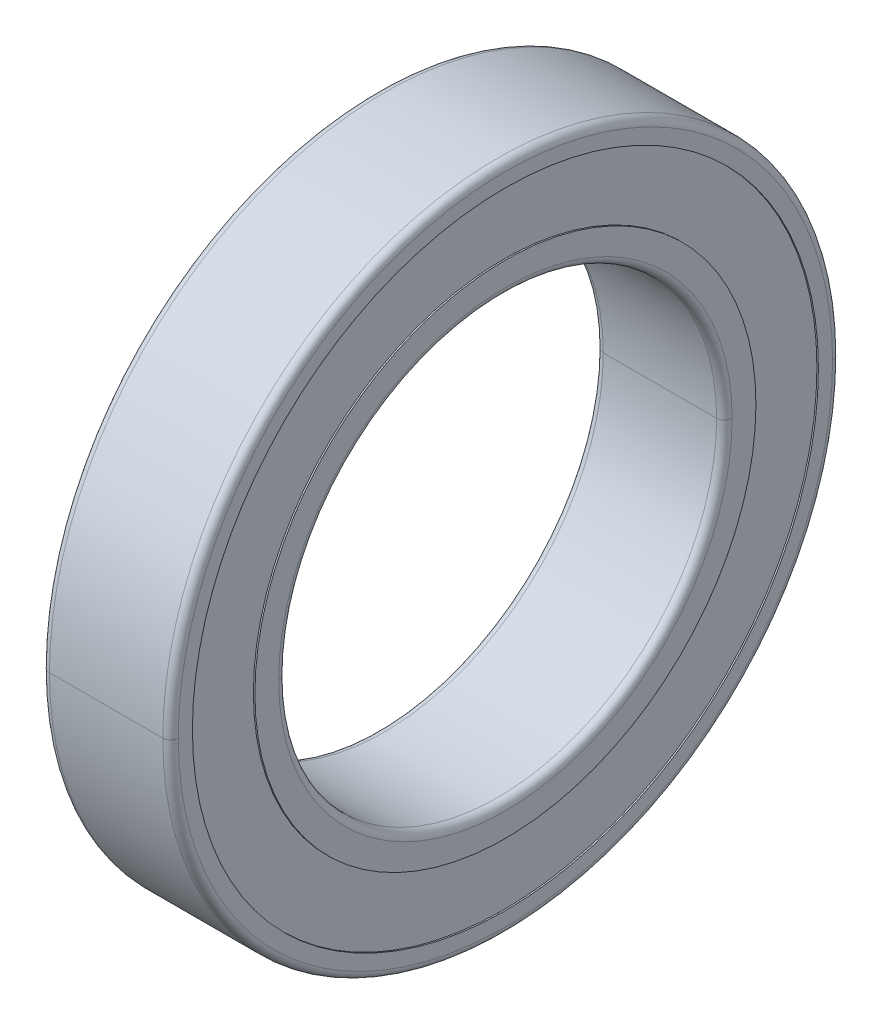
ISO-10303-21;
HEADER;
FILE_DESCRIPTION(('STEP AP214'),'2;1');
FILE_NAME('part.step','',(''),(''),'','','');
FILE_SCHEMA(('AUTOMOTIVE_DESIGN { 1 0 10303 214 1 1 1 1 }'));
ENDSEC;
DATA;
#1=APPLICATION_CONTEXT('core data for automotive mechanical design processes');
#2=APPLICATION_PROTOCOL_DEFINITION('international standard','automotive_design',2000,#1);
#3=PRODUCT_CONTEXT('',#1,'mechanical');
#4=PRODUCT('Part','Part','',(#3));
#5=PRODUCT_RELATED_PRODUCT_CATEGORY('part','',(#4));
#6=PRODUCT_DEFINITION_FORMATION('','',#4);
#7=PRODUCT_DEFINITION_CONTEXT('part definition',#1,'design');
#8=PRODUCT_DEFINITION('design','',#6,#7);
#9=PRODUCT_DEFINITION_SHAPE('','',#8);
#10=(LENGTH_UNIT() NAMED_UNIT(*) SI_UNIT(.MILLI.,.METRE.));
#11=(NAMED_UNIT(*) PLANE_ANGLE_UNIT() SI_UNIT($,.RADIAN.));
#12=(NAMED_UNIT(*) SI_UNIT($,.STERADIAN.) SOLID_ANGLE_UNIT());
#13=UNCERTAINTY_MEASURE_WITH_UNIT(LENGTH_MEASURE(1.E-05),#10,'distance_accuracy_value','');
#14=(GEOMETRIC_REPRESENTATION_CONTEXT(3) GLOBAL_UNCERTAINTY_ASSIGNED_CONTEXT((#13)) GLOBAL_UNIT_ASSIGNED_CONTEXT((#10,
#11,#12)) REPRESENTATION_CONTEXT('',''));
#15=CARTESIAN_POINT('',(0.,0.,0.));
#16=DIRECTION('',(0.,0.,1.));
#17=DIRECTION('',(1.,0.,0.));
#18=AXIS2_PLACEMENT_3D('',#15,#16,#17);
#19=CARTESIAN_POINT('',(0.,9.725,0.));
#20=DIRECTION('',(-1.,0.,0.));
#21=DIRECTION('',(0.,0.,1.));
#22=AXIS2_PLACEMENT_3D('',#19,#20,#21);
#23=PLANE('',#22);
#24=CARTESIAN_POINT('',(0.,0.,0.));
#25=DIRECTION('',(1.,0.,0.));
#26=DIRECTION('',(0.,0.,-1.));
#27=AXIS2_PLACEMENT_3D('',#24,#25,#26);
#28=CIRCLE('',#27,8.8);
#29=CARTESIAN_POINT('',(0.,0.,-8.8));
#30=VERTEX_POINT('',#29);
#31=CARTESIAN_POINT('',(0.,0.,8.8));
#32=VERTEX_POINT('',#31);
#33=EDGE_CURVE('E11',#30,#32,#28,.T.);
#34=ORIENTED_EDGE('',*,*,#33,.T.);
#35=CARTESIAN_POINT('',(0.,0.,0.));
#36=DIRECTION('',(1.,0.,0.));
#37=DIRECTION('',(0.,0.,-1.));
#38=AXIS2_PLACEMENT_3D('',#35,#36,#37);
#39=CIRCLE('',#38,8.8);
#40=EDGE_CURVE('E24',#32,#30,#39,.T.);
#41=ORIENTED_EDGE('',*,*,#40,.T.);
#42=EDGE_LOOP('',(#34,#41));
#43=FACE_BOUND('',#42,.T.);
#44=CARTESIAN_POINT('',(0.,0.,0.));
#45=DIRECTION('',(1.,0.,0.));
#46=DIRECTION('',(0.,0.,-1.));
#47=AXIS2_PLACEMENT_3D('',#44,#45,#46);
#48=CIRCLE('',#47,9.725);
#49=CARTESIAN_POINT('',(0.,0.,-9.725));
#50=VERTEX_POINT('',#49);
#51=CARTESIAN_POINT('',(0.,0.,9.725));
#52=VERTEX_POINT('',#51);
#53=EDGE_CURVE('E533',#50,#52,#48,.T.);
#54=ORIENTED_EDGE('',*,*,#53,.F.);
#55=CARTESIAN_POINT('',(0.,0.,0.));
#56=DIRECTION('',(1.,0.,0.));
#57=DIRECTION('',(0.,0.,-1.));
#58=AXIS2_PLACEMENT_3D('',#55,#56,#57);
#59=CIRCLE('',#58,9.725);
#60=EDGE_CURVE('E528',#52,#50,#59,.T.);
#61=ORIENTED_EDGE('',*,*,#60,.F.);
#62=EDGE_LOOP('',(#54,#61));
#63=FACE_BOUND('',#62,.T.);
#64=ADVANCED_FACE('F16',(#43,#63),#23,.T.);
#65=CARTESIAN_POINT('',(5.,0.,0.));
#66=DIRECTION('',(-1.,0.,0.));
#67=DIRECTION('',(0.,1.,0.));
#68=AXIS2_PLACEMENT_3D('',#65,#66,#67);
#69=CYLINDRICAL_SURFACE('',#68,9.725);
#70=ORIENTED_EDGE('',*,*,#60,.T.);
#71=DIRECTION('',(-1.,0.,0.));
#72=VECTOR('',#71,1.);
#73=CARTESIAN_POINT('',(0.0575000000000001,0.,-9.725));
#74=LINE('',#73,#72);
#75=CARTESIAN_POINT('',(0.0575000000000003,0.,-9.725));
#76=VERTEX_POINT('',#75);
#77=EDGE_CURVE('E523',#76,#50,#74,.T.);
#78=ORIENTED_EDGE('',*,*,#77,.F.);
#79=CARTESIAN_POINT('',(0.0575000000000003,0.,0.));
#80=DIRECTION('',(1.,0.,0.));
#81=DIRECTION('',(0.,0.,-1.));
#82=AXIS2_PLACEMENT_3D('',#79,#80,#81);
#83=CIRCLE('',#82,9.725);
#84=CARTESIAN_POINT('',(0.0575000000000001,0.,9.725));
#85=VERTEX_POINT('',#84);
#86=EDGE_CURVE('E518',#85,#76,#83,.T.);
#87=ORIENTED_EDGE('',*,*,#86,.F.);
#88=DIRECTION('',(-1.,0.,0.));
#89=VECTOR('',#88,1.);
#90=CARTESIAN_POINT('',(0.0575000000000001,0.,9.725));
#91=LINE('',#90,#89);
#92=EDGE_CURVE('E513',#85,#52,#91,.T.);
#93=ORIENTED_EDGE('',*,*,#92,.T.);
#94=EDGE_LOOP('',(#70,#78,#87,#93));
#95=FACE_BOUND('',#94,.T.);
#96=ADVANCED_FACE('F548',(#95),#69,.T.);
#97=CARTESIAN_POINT('',(5.,0.,0.));
#98=DIRECTION('',(-1.,0.,0.));
#99=DIRECTION('',(0.,-1.,0.));
#100=AXIS2_PLACEMENT_3D('',#97,#98,#99);
#101=CYLINDRICAL_SURFACE('',#100,9.725);
#102=CARTESIAN_POINT('',(0.0575000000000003,0.,0.));
#103=DIRECTION('',(1.,0.,0.));
#104=DIRECTION('',(0.,0.,-1.));
#105=AXIS2_PLACEMENT_3D('',#102,#103,#104);
#106=CIRCLE('',#105,9.725);
#107=EDGE_CURVE('E508',#76,#85,#106,.T.);
#108=ORIENTED_EDGE('',*,*,#107,.F.);
#109=ORIENTED_EDGE('',*,*,#77,.T.);
#110=ORIENTED_EDGE('',*,*,#53,.T.);
#111=ORIENTED_EDGE('',*,*,#92,.F.);
#112=EDGE_LOOP('',(#108,#109,#110,#111));
#113=FACE_BOUND('',#112,.T.);
#114=ADVANCED_FACE('F545',(#113),#101,.T.);
#115=CARTESIAN_POINT('',(0.0575,12.15,0.));
#116=DIRECTION('',(-1.,0.,0.));
#117=DIRECTION('',(0.,0.,1.));
#118=AXIS2_PLACEMENT_3D('',#115,#116,#117);
#119=PLANE('',#118);
#120=ORIENTED_EDGE('',*,*,#107,.T.);
#121=ORIENTED_EDGE('',*,*,#86,.T.);
#122=EDGE_LOOP('',(#120,#121));
#123=FACE_BOUND('',#122,.T.);
#124=CARTESIAN_POINT('',(0.0575000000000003,0.,0.));
#125=DIRECTION('',(1.,0.,0.));
#126=DIRECTION('',(0.,0.,-1.));
#127=AXIS2_PLACEMENT_3D('',#124,#125,#126);
#128=CIRCLE('',#127,12.15);
#129=CARTESIAN_POINT('',(0.0575000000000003,0.,-12.15));
#130=VERTEX_POINT('',#129);
#131=CARTESIAN_POINT('',(0.0575000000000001,0.,12.15));
#132=VERTEX_POINT('',#131);
#133=EDGE_CURVE('E503',#130,#132,#128,.T.);
#134=ORIENTED_EDGE('',*,*,#133,.F.);
#135=CARTESIAN_POINT('',(0.0575000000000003,0.,0.));
#136=DIRECTION('',(1.,0.,0.));
#137=DIRECTION('',(0.,0.,-1.));
#138=AXIS2_PLACEMENT_3D('',#135,#136,#137);
#139=CIRCLE('',#138,12.15);
#140=EDGE_CURVE('E498',#132,#130,#139,.T.);
#141=ORIENTED_EDGE('',*,*,#140,.F.);
#142=EDGE_LOOP('',(#134,#141));
#143=FACE_BOUND('',#142,.T.);
#144=ADVANCED_FACE('F550',(#123,#143),#119,.T.);
#145=CARTESIAN_POINT('',(5.,0.,0.));
#146=DIRECTION('',(-1.,0.,0.));
#147=DIRECTION('',(0.,1.,0.));
#148=AXIS2_PLACEMENT_3D('',#145,#146,#147);
#149=CYLINDRICAL_SURFACE('',#148,12.15);
#150=CARTESIAN_POINT('',(0.,0.,0.));
#151=DIRECTION('',(1.,0.,0.));
#152=DIRECTION('',(0.,0.,-1.));
#153=AXIS2_PLACEMENT_3D('',#150,#151,#152);
#154=CIRCLE('',#153,12.15);
#155=CARTESIAN_POINT('',(0.,0.,12.15));
#156=VERTEX_POINT('',#155);
#157=CARTESIAN_POINT('',(0.,0.,-12.15));
#158=VERTEX_POINT('',#157);
#159=EDGE_CURVE('E493',#156,#158,#154,.T.);
#160=ORIENTED_EDGE('',*,*,#159,.F.);
#161=DIRECTION('',(-1.,0.,0.));
#162=VECTOR('',#161,1.);
#163=CARTESIAN_POINT('',(0.0575000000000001,0.,12.15));
#164=LINE('',#163,#162);
#165=EDGE_CURVE('E488',#132,#156,#164,.T.);
#166=ORIENTED_EDGE('',*,*,#165,.F.);
#167=ORIENTED_EDGE('',*,*,#140,.T.);
#168=DIRECTION('',(-1.,0.,0.));
#169=VECTOR('',#168,1.);
#170=CARTESIAN_POINT('',(0.0575000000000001,0.,-12.15));
#171=LINE('',#170,#169);
#172=EDGE_CURVE('E484',#130,#158,#171,.T.);
#173=ORIENTED_EDGE('',*,*,#172,.T.);
#174=EDGE_LOOP('',(#160,#166,#167,#173));
#175=FACE_BOUND('',#174,.T.);
#176=ADVANCED_FACE('F553',(#175),#149,.F.);
#177=CARTESIAN_POINT('',(5.,0.,0.));
#178=DIRECTION('',(-1.,0.,0.));
#179=DIRECTION('',(0.,-1.,0.));
#180=AXIS2_PLACEMENT_3D('',#177,#178,#179);
#181=CYLINDRICAL_SURFACE('',#180,12.15);
#182=ORIENTED_EDGE('',*,*,#133,.T.);
#183=ORIENTED_EDGE('',*,*,#165,.T.);
#184=CARTESIAN_POINT('',(0.,0.,0.));
#185=DIRECTION('',(1.,0.,0.));
#186=DIRECTION('',(0.,0.,-1.));
#187=AXIS2_PLACEMENT_3D('',#184,#185,#186);
#188=CIRCLE('',#187,12.15);
#189=EDGE_CURVE('E479',#158,#156,#188,.T.);
#190=ORIENTED_EDGE('',*,*,#189,.F.);
#191=ORIENTED_EDGE('',*,*,#172,.F.);
#192=EDGE_LOOP('',(#182,#183,#190,#191));
#193=FACE_BOUND('',#192,.T.);
#194=ADVANCED_FACE('F560',(#193),#181,.F.);
#195=CARTESIAN_POINT('',(0.,12.7,0.));
#196=DIRECTION('',(-1.,0.,0.));
#197=DIRECTION('',(0.,0.,1.));
#198=AXIS2_PLACEMENT_3D('',#195,#196,#197);
#199=PLANE('',#198);
#200=ORIENTED_EDGE('',*,*,#189,.T.);
#201=ORIENTED_EDGE('',*,*,#159,.T.);
#202=EDGE_LOOP('',(#200,#201));
#203=FACE_BOUND('',#202,.T.);
#204=CARTESIAN_POINT('',(0.,0.,0.));
#205=DIRECTION('',(1.,0.,0.));
#206=DIRECTION('',(0.,0.,-1.));
#207=AXIS2_PLACEMENT_3D('',#204,#205,#206);
#208=CIRCLE('',#207,12.7);
#209=CARTESIAN_POINT('',(0.,0.,-12.7));
#210=VERTEX_POINT('',#209);
#211=CARTESIAN_POINT('',(0.,0.,12.7));
#212=VERTEX_POINT('',#211);
#213=EDGE_CURVE('E475',#210,#212,#208,.T.);
#214=ORIENTED_EDGE('',*,*,#213,.F.);
#215=CARTESIAN_POINT('',(0.,0.,0.));
#216=DIRECTION('',(1.,0.,0.));
#217=DIRECTION('',(0.,0.,-1.));
#218=AXIS2_PLACEMENT_3D('',#215,#216,#217);
#219=CIRCLE('',#218,12.7);
#220=EDGE_CURVE('E473',#212,#210,#219,.T.);
#221=ORIENTED_EDGE('',*,*,#220,.F.);
#222=EDGE_LOOP('',(#214,#221));
#223=FACE_BOUND('',#222,.T.);
#224=ADVANCED_FACE('F562',(#203,#223),#199,.T.);
#225=CARTESIAN_POINT('',(0.29999999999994,0.,0.));
#226=DIRECTION('',(1.,0.,0.));
#227=DIRECTION('',(0.,1.,0.));
#228=AXIS2_PLACEMENT_3D('',#225,#226,#227);
#229=TOROIDAL_SURFACE('',#228,12.7,0.3);
#230=ORIENTED_EDGE('',*,*,#220,.T.);
#231=CARTESIAN_POINT('',(0.,0.,-12.7));
#232=CARTESIAN_POINT('',(-1.04126692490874E-07,0.,-12.7049087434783));
#233=CARTESIAN_POINT('',(0.000120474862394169,0.,-12.7098174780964));
#234=CARTESIAN_POINT('',(0.000602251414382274,0.,-12.7196231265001));
#235=CARTESIAN_POINT('',(0.000963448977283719,0.,-12.7245200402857));
#236=CARTESIAN_POINT('',(0.00192571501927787,0.,-12.7342902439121));
#237=CARTESIAN_POINT('',(0.00252678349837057,0.,-12.7391635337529));
#238=CARTESIAN_POINT('',(0.00396731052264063,0.,-12.7488747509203));
#239=CARTESIAN_POINT('',(0.00480676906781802,0.,-12.7537126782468));
#240=CARTESIAN_POINT('',(0.00672206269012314,0.,-12.7633415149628));
#241=CARTESIAN_POINT('',(0.00779789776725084,0.,-12.7681324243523));
#242=CARTESIAN_POINT('',(0.0101833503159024,0.,-12.7776556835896));
#243=CARTESIAN_POINT('',(0.0114929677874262,0.,-12.7823880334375));
#244=CARTESIAN_POINT('',(0.0143428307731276,0.,-12.7917827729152));
#245=CARTESIAN_POINT('',(0.0158830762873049,0.,-12.7964451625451));
#246=CARTESIAN_POINT('',(0.0191904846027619,0.,-12.8056887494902));
#247=CARTESIAN_POINT('',(0.0209576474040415,0.,-12.8102699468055));
#248=CARTESIAN_POINT('',(0.0247146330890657,0.,-12.8193401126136));
#249=CARTESIAN_POINT('',(0.0267044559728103,0.,-12.8238290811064));
#250=CARTESIAN_POINT('',(0.0309019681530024,0.,-12.8327039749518));
#251=CARTESIAN_POINT('',(0.03310965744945,0.,-12.8370899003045));
#252=CARTESIAN_POINT('',(0.0377375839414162,0.,-12.8457481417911));
#253=CARTESIAN_POINT('',(0.0401578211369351,0.,-12.8500204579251));
#254=CARTESIAN_POINT('',(0.0452050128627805,0.,-12.8584411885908));
#255=CARTESIAN_POINT('',(0.0478319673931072,0.,-12.8625896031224));
#256=CARTESIAN_POINT('',(0.0532862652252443,0.,-12.8707525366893));
#257=CARTESIAN_POINT('',(0.0561136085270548,0.,-12.8747670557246));
#258=CARTESIAN_POINT('',(0.0619618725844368,0.,-12.8826525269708));
#259=CARTESIAN_POINT('',(0.0649827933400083,0.,-12.8865234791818));
#260=CARTESIAN_POINT('',(0.0712109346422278,0.,-12.8941124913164));
#261=CARTESIAN_POINT('',(0.0744181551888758,0.,-12.8978305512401));
#262=CARTESIAN_POINT('',(0.0810111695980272,0.,-12.9051048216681));
#263=CARTESIAN_POINT('',(0.0843969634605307,0.,-12.9086610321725));
#264=CARTESIAN_POINT('',(0.0913389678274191,0.,-12.9156030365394));
#265=CARTESIAN_POINT('',(0.0948951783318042,0.,-12.9189888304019));
#266=CARTESIAN_POINT('',(0.102169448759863,0.,-12.9255818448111));
#267=CARTESIAN_POINT('',(0.105887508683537,0.,-12.9287890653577));
#268=CARTESIAN_POINT('',(0.113476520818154,0.,-12.9350172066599));
#269=CARTESIAN_POINT('',(0.117347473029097,0.,-12.9380381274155));
#270=CARTESIAN_POINT('',(0.125232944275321,0.,-12.9438863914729));
#271=CARTESIAN_POINT('',(0.129247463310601,0.,-12.9467137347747));
#272=CARTESIAN_POINT('',(0.137410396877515,0.,-12.9521680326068));
#273=CARTESIAN_POINT('',(0.141558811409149,0.,-12.9547949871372));
#274=CARTESIAN_POINT('',(0.149979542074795,0.,-12.959842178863));
#275=CARTESIAN_POINT('',(0.154251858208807,0.,-12.9622624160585));
#276=CARTESIAN_POINT('',(0.162910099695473,0.,-12.9668903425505));
#277=CARTESIAN_POINT('',(0.167296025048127,0.,-12.9690980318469));
#278=CARTESIAN_POINT('',(0.176170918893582,0.,-12.9732955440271));
#279=CARTESIAN_POINT('',(0.180659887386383,0.,-12.9752853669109));
#280=CARTESIAN_POINT('',(0.189730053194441,0.,-12.9790423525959));
#281=CARTESIAN_POINT('',(0.194311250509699,0.,-12.9808095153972));
#282=CARTESIAN_POINT('',(0.203554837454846,0.,-12.9841169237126));
#283=CARTESIAN_POINT('',(0.208217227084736,0.,-12.9856571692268));
#284=CARTESIAN_POINT('',(0.217611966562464,0.,-12.9885070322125));
#285=CARTESIAN_POINT('',(0.222344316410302,0.,-12.989816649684));
#286=CARTESIAN_POINT('',(0.231867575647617,0.,-12.9922021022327));
#287=CARTESIAN_POINT('',(0.236658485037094,0.,-12.9932779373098));
#288=CARTESIAN_POINT('',(0.246287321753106,0.,-12.9951932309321));
#289=CARTESIAN_POINT('',(0.251125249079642,0.,-12.9960326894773));
#290=CARTESIAN_POINT('',(0.260836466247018,0.,-12.9974732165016));
#291=CARTESIAN_POINT('',(0.265709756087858,0.,-12.9980742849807));
#292=CARTESIAN_POINT('',(0.275479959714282,0.,-12.9990365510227));
#293=CARTESIAN_POINT('',(0.280376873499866,0.,-12.9993977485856));
#294=CARTESIAN_POINT('',(0.290182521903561,0.,-12.9998795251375));
#295=CARTESIAN_POINT('',(0.295091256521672,0.,-13.0000001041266));
#296=CARTESIAN_POINT('',(0.299999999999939,0.,-13.));
#297=B_SPLINE_CURVE_WITH_KNOTS('',3,(#231,#232,#233,#234,#235,#236,#237,#238,#239,#240,#241,
#242,#243,#244,#245,#246,#247,#248,#249,#250,#251,#252,#253,#254,#255,#256,#257,#258,#259,#260,
#261,#262,#263,#264,#265,#266,#267,#268,#269,#270,#271,#272,#273,#274,#275,#276,#277,#278,#279,
#280,#281,#282,#283,#284,#285,#286,#287,#288,#289,#290,#291,#292,#293,#294,#295,#296),
.UNSPECIFIED.,.F.,.F.,(4,2,2,2,2,2,2,2,2,2,2,2,2,2,2,2,2,2,2,2,2,2,2,2,2,2,2,2,2,2,2,2,4),(0.,
0.0147247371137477,0.0294494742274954,0.0441742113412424,0.0588989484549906,0.0736236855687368,
0.0883484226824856,0.103073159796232,0.117797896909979,0.132522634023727,0.147247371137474,
0.161972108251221,0.176696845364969,0.191421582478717,0.206146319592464,0.220871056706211,
0.235595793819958,0.250320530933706,0.265045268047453,0.2797700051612,0.294494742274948,
0.309219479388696,0.323944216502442,0.33866895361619,0.353393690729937,0.368118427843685,
0.382843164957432,0.39756790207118,0.412292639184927,0.427017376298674,0.441742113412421,
0.456466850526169,0.471191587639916),.UNSPECIFIED.);
#298=CARTESIAN_POINT('',(0.3,0.,-13.));
#299=VERTEX_POINT('',#298);
#300=EDGE_CURVE('E441',#210,#299,#297,.T.);
#301=ORIENTED_EDGE('',*,*,#300,.T.);
#302=CARTESIAN_POINT('',(0.3,0.,0.));
#303=DIRECTION('',(1.,0.,0.));
#304=DIRECTION('',(0.,0.,-1.));
#305=AXIS2_PLACEMENT_3D('',#302,#303,#304);
#306=CIRCLE('',#305,13.);
#307=CARTESIAN_POINT('',(0.3,0.,13.));
#308=VERTEX_POINT('',#307);
#309=EDGE_CURVE('E459',#308,#299,#306,.T.);
#310=ORIENTED_EDGE('',*,*,#309,.F.);
#311=CARTESIAN_POINT('',(0.,0.,12.7));
#312=CARTESIAN_POINT('',(-1.041266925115E-07,0.,12.7049087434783));
#313=CARTESIAN_POINT('',(0.000120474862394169,0.,12.7098174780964));
#314=CARTESIAN_POINT('',(0.000602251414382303,0.,12.7196231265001));
#315=CARTESIAN_POINT('',(0.000963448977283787,0.,12.7245200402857));
#316=CARTESIAN_POINT('',(0.00192571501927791,0.,12.7342902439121));
#317=CARTESIAN_POINT('',(0.00252678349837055,0.,12.7391635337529));
#318=CARTESIAN_POINT('',(0.00396731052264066,0.,12.7488747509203));
#319=CARTESIAN_POINT('',(0.00480676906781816,0.,12.7537126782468));
#320=CARTESIAN_POINT('',(0.00672206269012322,0.,12.7633415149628));
#321=CARTESIAN_POINT('',(0.00779789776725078,0.,12.7681324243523));
#322=CARTESIAN_POINT('',(0.0101833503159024,0.,12.7776556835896));
#323=CARTESIAN_POINT('',(0.0114929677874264,0.,12.7823880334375));
#324=CARTESIAN_POINT('',(0.0143428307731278,0.,12.7917827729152));
#325=CARTESIAN_POINT('',(0.0158830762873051,0.,12.7964451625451));
#326=CARTESIAN_POINT('',(0.019190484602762,0.,12.8056887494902));
#327=CARTESIAN_POINT('',(0.0209576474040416,0.,12.8102699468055));
#328=CARTESIAN_POINT('',(0.0247146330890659,0.,12.8193401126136));
#329=CARTESIAN_POINT('',(0.0267044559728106,0.,12.8238290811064));
#330=CARTESIAN_POINT('',(0.0309019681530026,0.,12.8327039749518));
#331=CARTESIAN_POINT('',(0.0331096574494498,0.,12.8370899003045));
#332=CARTESIAN_POINT('',(0.0377375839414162,0.,12.8457481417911));
#333=CARTESIAN_POINT('',(0.0401578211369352,0.,12.8500204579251));
#334=CARTESIAN_POINT('',(0.0452050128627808,0.,12.8584411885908));
#335=CARTESIAN_POINT('',(0.0478319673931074,0.,12.8625896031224));
#336=CARTESIAN_POINT('',(0.0532862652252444,0.,12.8707525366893));
#337=CARTESIAN_POINT('',(0.0561136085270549,0.,12.8747670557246));
#338=CARTESIAN_POINT('',(0.061961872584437,0.,12.8826525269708));
#339=CARTESIAN_POINT('',(0.0649827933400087,0.,12.8865234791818));
#340=CARTESIAN_POINT('',(0.0712109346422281,0.,12.8941124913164));
#341=CARTESIAN_POINT('',(0.0744181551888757,0.,12.8978305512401));
#342=CARTESIAN_POINT('',(0.0810111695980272,0.,12.9051048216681));
#343=CARTESIAN_POINT('',(0.084396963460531,0.,12.9086610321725));
#344=CARTESIAN_POINT('',(0.0913389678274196,0.,12.9156030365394));
#345=CARTESIAN_POINT('',(0.0948951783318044,0.,12.9189888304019));
#346=CARTESIAN_POINT('',(0.102169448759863,0.,12.9255818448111));
#347=CARTESIAN_POINT('',(0.105887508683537,0.,12.9287890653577));
#348=CARTESIAN_POINT('',(0.113476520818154,0.,12.9350172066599));
#349=CARTESIAN_POINT('',(0.117347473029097,0.,12.9380381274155));
#350=CARTESIAN_POINT('',(0.125232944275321,0.,12.9438863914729));
#351=CARTESIAN_POINT('',(0.129247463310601,0.,12.9467137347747));
#352=CARTESIAN_POINT('',(0.137410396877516,0.,12.9521680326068));
#353=CARTESIAN_POINT('',(0.14155881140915,0.,12.9547949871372));
#354=CARTESIAN_POINT('',(0.149979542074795,0.,12.959842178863));
#355=CARTESIAN_POINT('',(0.154251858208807,0.,12.9622624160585));
#356=CARTESIAN_POINT('',(0.162910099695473,0.,12.9668903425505));
#357=CARTESIAN_POINT('',(0.167296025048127,0.,12.9690980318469));
#358=CARTESIAN_POINT('',(0.176170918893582,0.,12.9732955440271));
#359=CARTESIAN_POINT('',(0.180659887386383,0.,12.9752853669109));
#360=CARTESIAN_POINT('',(0.189730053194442,0.,12.9790423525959));
#361=CARTESIAN_POINT('',(0.194311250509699,0.,12.9808095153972));
#362=CARTESIAN_POINT('',(0.203554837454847,0.,12.9841169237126));
#363=CARTESIAN_POINT('',(0.208217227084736,0.,12.9856571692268));
#364=CARTESIAN_POINT('',(0.217611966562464,0.,12.9885070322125));
#365=CARTESIAN_POINT('',(0.222344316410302,0.,12.989816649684));
#366=CARTESIAN_POINT('',(0.231867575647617,0.,12.9922021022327));
#367=CARTESIAN_POINT('',(0.236658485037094,0.,12.9932779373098));
#368=CARTESIAN_POINT('',(0.246287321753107,0.,12.9951932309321));
#369=CARTESIAN_POINT('',(0.251125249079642,0.,12.9960326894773));
#370=CARTESIAN_POINT('',(0.260836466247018,0.,12.9974732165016));
#371=CARTESIAN_POINT('',(0.265709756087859,0.,12.9980742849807));
#372=CARTESIAN_POINT('',(0.275479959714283,0.,12.9990365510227));
#373=CARTESIAN_POINT('',(0.280376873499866,0.,12.9993977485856));
#374=CARTESIAN_POINT('',(0.290182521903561,0.,12.9998795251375));
#375=CARTESIAN_POINT('',(0.295091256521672,0.,13.0000001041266));
#376=CARTESIAN_POINT('',(0.299999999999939,0.,13.));
#377=B_SPLINE_CURVE_WITH_KNOTS('',3,(#311,#312,#313,#314,#315,#316,#317,#318,#319,#320,#321,
#322,#323,#324,#325,#326,#327,#328,#329,#330,#331,#332,#333,#334,#335,#336,#337,#338,#339,#340,
#341,#342,#343,#344,#345,#346,#347,#348,#349,#350,#351,#352,#353,#354,#355,#356,#357,#358,#359,
#360,#361,#362,#363,#364,#365,#366,#367,#368,#369,#370,#371,#372,#373,#374,#375,#376),
.UNSPECIFIED.,.F.,.F.,(4,2,2,2,2,2,2,2,2,2,2,2,2,2,2,2,2,2,2,2,2,2,2,2,2,2,2,2,2,2,2,2,4),(0.,
0.0147247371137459,0.0294494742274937,0.0441742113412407,0.0588989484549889,0.0736236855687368,
0.0883484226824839,0.10307315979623,0.117797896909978,0.132522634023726,0.147247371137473,
0.16197210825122,0.176696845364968,0.191421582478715,0.206146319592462,0.22087105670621,
0.235595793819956,0.250320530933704,0.265045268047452,0.279770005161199,0.294494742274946,
0.309219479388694,0.323944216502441,0.338668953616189,0.353393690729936,0.368118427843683,
0.382843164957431,0.397567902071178,0.412292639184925,0.427017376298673,0.44174211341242,
0.456466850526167,0.471191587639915),.UNSPECIFIED.);
#378=EDGE_CURVE('E444',#212,#308,#377,.T.);
#379=ORIENTED_EDGE('',*,*,#378,.F.);
#380=EDGE_LOOP('',(#230,#301,#310,#379));
#381=FACE_BOUND('',#380,.T.);
#382=ADVANCED_FACE('F424',(#381),#229,.T.);
#383=CARTESIAN_POINT('',(0.29999999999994,0.,0.));
#384=DIRECTION('',(1.,0.,0.));
#385=DIRECTION('',(0.,-1.,0.));
#386=AXIS2_PLACEMENT_3D('',#383,#384,#385);
#387=TOROIDAL_SURFACE('',#386,12.7,0.3);
#388=CARTESIAN_POINT('',(0.3,0.,0.));
#389=DIRECTION('',(1.,0.,0.));
#390=DIRECTION('',(0.,0.,-1.));
#391=AXIS2_PLACEMENT_3D('',#388,#389,#390);
#392=CIRCLE('',#391,13.);
#393=EDGE_CURVE('E404',#299,#308,#392,.T.);
#394=ORIENTED_EDGE('',*,*,#393,.F.);
#395=ORIENTED_EDGE('',*,*,#300,.F.);
#396=ORIENTED_EDGE('',*,*,#213,.T.);
#397=ORIENTED_EDGE('',*,*,#378,.T.);
#398=EDGE_LOOP('',(#394,#395,#396,#397));
#399=FACE_BOUND('',#398,.T.);
#400=ADVANCED_FACE('F413',(#399),#387,.T.);
#401=CARTESIAN_POINT('',(5.,0.,0.));
#402=DIRECTION('',(-1.,0.,0.));
#403=DIRECTION('',(0.,-1.,0.));
#404=AXIS2_PLACEMENT_3D('',#401,#402,#403);
#405=CYLINDRICAL_SURFACE('',#404,13.);
#406=CARTESIAN_POINT('',(4.7,0.,0.));
#407=DIRECTION('',(1.,0.,0.));
#408=DIRECTION('',(0.,0.,-1.));
#409=AXIS2_PLACEMENT_3D('',#406,#407,#408);
#410=CIRCLE('',#409,13.);
#411=CARTESIAN_POINT('',(4.7,0.,-13.));
#412=VERTEX_POINT('',#411);
#413=CARTESIAN_POINT('',(4.70000000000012,0.,13.));
#414=VERTEX_POINT('',#413);
#415=EDGE_CURVE('E400',#412,#414,#410,.T.);
#416=ORIENTED_EDGE('',*,*,#415,.F.);
#417=DIRECTION('',(-1.,0.,0.));
#418=VECTOR('',#417,1.);
#419=CARTESIAN_POINT('',(4.7,0.,-13.));
#420=LINE('',#419,#418);
#421=EDGE_CURVE('E395',#412,#299,#420,.T.);
#422=ORIENTED_EDGE('',*,*,#421,.T.);
#423=ORIENTED_EDGE('',*,*,#393,.T.);
#424=DIRECTION('',(-1.,0.,0.));
#425=VECTOR('',#424,1.);
#426=CARTESIAN_POINT('',(4.7,0.,13.));
#427=LINE('',#426,#425);
#428=EDGE_CURVE('E390',#414,#308,#427,.T.);
#429=ORIENTED_EDGE('',*,*,#428,.F.);
#430=EDGE_LOOP('',(#416,#422,#423,#429));
#431=FACE_BOUND('',#430,.T.);
#432=ADVANCED_FACE('F423',(#431),#405,.T.);
#433=CARTESIAN_POINT('',(5.,0.,0.));
#434=DIRECTION('',(-1.,0.,0.));
#435=DIRECTION('',(0.,1.,0.));
#436=AXIS2_PLACEMENT_3D('',#433,#434,#435);
#437=CYLINDRICAL_SURFACE('',#436,13.);
#438=ORIENTED_EDGE('',*,*,#309,.T.);
#439=ORIENTED_EDGE('',*,*,#421,.F.);
#440=CARTESIAN_POINT('',(4.7,0.,0.));
#441=DIRECTION('',(1.,0.,0.));
#442=DIRECTION('',(0.,0.,-1.));
#443=AXIS2_PLACEMENT_3D('',#440,#441,#442);
#444=CIRCLE('',#443,13.);
#445=EDGE_CURVE('E388',#414,#412,#444,.T.);
#446=ORIENTED_EDGE('',*,*,#445,.F.);
#447=ORIENTED_EDGE('',*,*,#428,.T.);
#448=EDGE_LOOP('',(#438,#439,#446,#447));
#449=FACE_BOUND('',#448,.T.);
#450=ADVANCED_FACE('F613',(#449),#437,.T.);
#451=CARTESIAN_POINT('',(4.70000000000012,0.,0.));
#452=DIRECTION('',(1.,0.,0.));
#453=DIRECTION('',(0.,1.,0.));
#454=AXIS2_PLACEMENT_3D('',#451,#452,#453);
#455=TOROIDAL_SURFACE('',#454,12.7,0.3);
#456=ORIENTED_EDGE('',*,*,#445,.T.);
#457=CARTESIAN_POINT('',(4.70000000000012,0.,-13.));
#458=CARTESIAN_POINT('',(4.70490874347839,0.,-13.0000001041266));
#459=CARTESIAN_POINT('',(4.7098174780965,0.,-12.9998795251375));
#460=CARTESIAN_POINT('',(4.71962312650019,0.,-12.9993977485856));
#461=CARTESIAN_POINT('',(4.72452004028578,0.,-12.9990365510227));
#462=CARTESIAN_POINT('',(4.7342902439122,0.,-12.9980742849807));
#463=CARTESIAN_POINT('',(4.73916353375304,0.,-12.9974732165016));
#464=CARTESIAN_POINT('',(4.74887475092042,0.,-12.9960326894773));
#465=CARTESIAN_POINT('',(4.75371267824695,0.,-12.9951932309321));
#466=CARTESIAN_POINT('',(4.76334151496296,0.,-12.9932779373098));
#467=CARTESIAN_POINT('',(4.76813242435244,0.,-12.9922021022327));
#468=CARTESIAN_POINT('',(4.77765568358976,0.,-12.989816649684));
#469=CARTESIAN_POINT('',(4.78238803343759,0.,-12.9885070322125));
#470=CARTESIAN_POINT('',(4.79178277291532,0.,-12.9856571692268));
#471=CARTESIAN_POINT('',(4.79644516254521,0.,-12.9841169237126));
#472=CARTESIAN_POINT('',(4.80568874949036,0.,-12.9808095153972));
#473=CARTESIAN_POINT('',(4.81026994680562,0.,-12.9790423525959));
#474=CARTESIAN_POINT('',(4.81934011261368,0.,-12.9752853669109));
#475=CARTESIAN_POINT('',(4.82382908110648,0.,-12.9732955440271));
#476=CARTESIAN_POINT('',(4.83270397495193,0.,-12.9690980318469));
#477=CARTESIAN_POINT('',(4.83708990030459,0.,-12.9668903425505));
#478=CARTESIAN_POINT('',(4.84574814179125,0.,-12.9622624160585));
#479=CARTESIAN_POINT('',(4.85002045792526,0.,-12.959842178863));
#480=CARTESIAN_POINT('',(4.85844118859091,0.,-12.9547949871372));
#481=CARTESIAN_POINT('',(4.86258960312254,0.,-12.9521680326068));
#482=CARTESIAN_POINT('',(4.87075253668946,0.,-12.9467137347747));
#483=CARTESIAN_POINT('',(4.87476705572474,0.,-12.9438863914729));
#484=CARTESIAN_POINT('',(4.88265252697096,0.,-12.9380381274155));
#485=CARTESIAN_POINT('',(4.8865234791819,0.,-12.9350172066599));
#486=CARTESIAN_POINT('',(4.89411249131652,0.,-12.9287890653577));
#487=CARTESIAN_POINT('',(4.8978305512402,0.,-12.9255818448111));
#488=CARTESIAN_POINT('',(4.90510482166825,0.,-12.9189888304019));
#489=CARTESIAN_POINT('',(4.90866103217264,0.,-12.9156030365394));
#490=CARTESIAN_POINT('',(4.91560303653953,0.,-12.9086610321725));
#491=CARTESIAN_POINT('',(4.91898883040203,0.,-12.9051048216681));
#492=CARTESIAN_POINT('',(4.92558184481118,0.,-12.8978305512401));
#493=CARTESIAN_POINT('',(4.92878906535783,0.,-12.8941124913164));
#494=CARTESIAN_POINT('',(4.93501720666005,0.,-12.8865234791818));
#495=CARTESIAN_POINT('',(4.93803812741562,0.,-12.8826525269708));
#496=CARTESIAN_POINT('',(4.943886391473,0.,-12.8747670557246));
#497=CARTESIAN_POINT('',(4.94671373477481,0.,-12.8707525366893));
#498=CARTESIAN_POINT('',(4.95216803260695,0.,-12.8625896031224));
#499=CARTESIAN_POINT('',(4.95479498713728,0.,-12.8584411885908));
#500=CARTESIAN_POINT('',(4.95984217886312,0.,-12.8500204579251));
#501=CARTESIAN_POINT('',(4.96226241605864,0.,-12.8457481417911));
#502=CARTESIAN_POINT('',(4.96689034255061,0.,-12.8370899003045));
#503=CARTESIAN_POINT('',(4.96909803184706,0.,-12.8327039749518));
#504=CARTESIAN_POINT('',(4.97329554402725,0.,-12.8238290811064));
#505=CARTESIAN_POINT('',(4.97528536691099,0.,-12.8193401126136));
#506=CARTESIAN_POINT('',(4.97904235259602,0.,-12.8102699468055));
#507=CARTESIAN_POINT('',(4.9808095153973,0.,-12.8056887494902));
#508=CARTESIAN_POINT('',(4.98411692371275,0.,-12.7964451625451));
#509=CARTESIAN_POINT('',(4.98565716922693,0.,-12.7917827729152));
#510=CARTESIAN_POINT('',(4.98850703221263,0.,-12.7823880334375));
#511=CARTESIAN_POINT('',(4.98981664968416,0.,-12.7776556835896));
#512=CARTESIAN_POINT('',(4.99220210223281,0.,-12.7681324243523));
#513=CARTESIAN_POINT('',(4.99327793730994,0.,-12.7633415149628));
#514=CARTESIAN_POINT('',(4.99519323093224,0.,-12.7537126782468));
#515=CARTESIAN_POINT('',(4.99603268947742,0.,-12.7488747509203));
#516=CARTESIAN_POINT('',(4.99747321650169,0.,-12.7391635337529));
#517=CARTESIAN_POINT('',(4.99807428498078,0.,-12.7342902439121));
#518=CARTESIAN_POINT('',(4.99903655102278,0.,-12.7245200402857));
#519=CARTESIAN_POINT('',(4.99939774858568,0.,-12.7196231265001));
#520=CARTESIAN_POINT('',(4.99987952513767,0.,-12.7098174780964));
#521=CARTESIAN_POINT('',(5.00000010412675,0.,-12.7049087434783));
#522=CARTESIAN_POINT('',(5.00000000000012,0.,-12.7));
#523=B_SPLINE_CURVE_WITH_KNOTS('',3,(#457,#458,#459,#460,#461,#462,#463,#464,#465,#466,#467,
#468,#469,#470,#471,#472,#473,#474,#475,#476,#477,#478,#479,#480,#481,#482,#483,#484,#485,#486,
#487,#488,#489,#490,#491,#492,#493,#494,#495,#496,#497,#498,#499,#500,#501,#502,#503,#504,#505,
#506,#507,#508,#509,#510,#511,#512,#513,#514,#515,#516,#517,#518,#519,#520,#521,#522),
.UNSPECIFIED.,.F.,.F.,(4,2,2,2,2,2,2,2,2,2,2,2,2,2,2,2,2,2,2,2,2,2,2,2,2,2,2,2,2,2,2,2,4),(0.,
0.0147247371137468,0.0294494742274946,0.0441742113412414,0.0588989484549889,0.0736236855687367,
0.0883484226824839,0.103073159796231,0.117797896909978,0.132522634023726,0.147247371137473,
0.161972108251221,0.176696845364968,0.191421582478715,0.206146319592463,0.220871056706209,
0.235595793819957,0.250320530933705,0.265045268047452,0.279770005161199,0.294494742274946,
0.309219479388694,0.323944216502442,0.338668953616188,0.353393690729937,0.368118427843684,
0.38284316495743,0.397567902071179,0.412292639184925,0.427017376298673,0.441742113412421,
0.456466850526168,0.471191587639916),.UNSPECIFIED.);
#524=CARTESIAN_POINT('',(5.,0.,-12.7));
#525=VERTEX_POINT('',#524);
#526=EDGE_CURVE('E356',#412,#525,#523,.T.);
#527=ORIENTED_EDGE('',*,*,#526,.T.);
#528=CARTESIAN_POINT('',(5.,0.,0.));
#529=DIRECTION('',(1.,0.,0.));
#530=DIRECTION('',(0.,0.,-1.));
#531=AXIS2_PLACEMENT_3D('',#528,#529,#530);
#532=CIRCLE('',#531,12.7);
#533=CARTESIAN_POINT('',(5.00000000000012,0.,12.7));
#534=VERTEX_POINT('',#533);
#535=EDGE_CURVE('E374',#534,#525,#532,.T.);
#536=ORIENTED_EDGE('',*,*,#535,.F.);
#537=CARTESIAN_POINT('',(4.70000000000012,0.,13.));
#538=CARTESIAN_POINT('',(4.70490874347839,0.,13.0000001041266));
#539=CARTESIAN_POINT('',(4.7098174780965,0.,12.9998795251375));
#540=CARTESIAN_POINT('',(4.71962312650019,0.,12.9993977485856));
#541=CARTESIAN_POINT('',(4.72452004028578,0.,12.9990365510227));
#542=CARTESIAN_POINT('',(4.7342902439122,0.,12.9980742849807));
#543=CARTESIAN_POINT('',(4.73916353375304,0.,12.9974732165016));
#544=CARTESIAN_POINT('',(4.74887475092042,0.,12.9960326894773));
#545=CARTESIAN_POINT('',(4.75371267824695,0.,12.9951932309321));
#546=CARTESIAN_POINT('',(4.76334151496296,0.,12.9932779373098));
#547=CARTESIAN_POINT('',(4.76813242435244,0.,12.9922021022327));
#548=CARTESIAN_POINT('',(4.77765568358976,0.,12.989816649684));
#549=CARTESIAN_POINT('',(4.78238803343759,0.,12.9885070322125));
#550=CARTESIAN_POINT('',(4.79178277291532,0.,12.9856571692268));
#551=CARTESIAN_POINT('',(4.79644516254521,0.,12.9841169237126));
#552=CARTESIAN_POINT('',(4.80568874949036,0.,12.9808095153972));
#553=CARTESIAN_POINT('',(4.81026994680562,0.,12.9790423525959));
#554=CARTESIAN_POINT('',(4.81934011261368,0.,12.9752853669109));
#555=CARTESIAN_POINT('',(4.82382908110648,0.,12.9732955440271));
#556=CARTESIAN_POINT('',(4.83270397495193,0.,12.9690980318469));
#557=CARTESIAN_POINT('',(4.83708990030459,0.,12.9668903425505));
#558=CARTESIAN_POINT('',(4.84574814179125,0.,12.9622624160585));
#559=CARTESIAN_POINT('',(4.85002045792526,0.,12.959842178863));
#560=CARTESIAN_POINT('',(4.85844118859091,0.,12.9547949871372));
#561=CARTESIAN_POINT('',(4.86258960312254,0.,12.9521680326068));
#562=CARTESIAN_POINT('',(4.87075253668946,0.,12.9467137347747));
#563=CARTESIAN_POINT('',(4.87476705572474,0.,12.9438863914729));
#564=CARTESIAN_POINT('',(4.88265252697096,0.,12.9380381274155));
#565=CARTESIAN_POINT('',(4.88652347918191,0.,12.9350172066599));
#566=CARTESIAN_POINT('',(4.89411249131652,0.,12.9287890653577));
#567=CARTESIAN_POINT('',(4.8978305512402,0.,12.9255818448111));
#568=CARTESIAN_POINT('',(4.90510482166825,0.,12.9189888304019));
#569=CARTESIAN_POINT('',(4.90866103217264,0.,12.9156030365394));
#570=CARTESIAN_POINT('',(4.91560303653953,0.,12.9086610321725));
#571=CARTESIAN_POINT('',(4.91898883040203,0.,12.9051048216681));
#572=CARTESIAN_POINT('',(4.92558184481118,0.,12.8978305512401));
#573=CARTESIAN_POINT('',(4.92878906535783,0.,12.8941124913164));
#574=CARTESIAN_POINT('',(4.93501720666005,0.,12.8865234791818));
#575=CARTESIAN_POINT('',(4.93803812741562,0.,12.8826525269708));
#576=CARTESIAN_POINT('',(4.943886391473,0.,12.8747670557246));
#577=CARTESIAN_POINT('',(4.94671373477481,0.,12.8707525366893));
#578=CARTESIAN_POINT('',(4.95216803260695,0.,12.8625896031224));
#579=CARTESIAN_POINT('',(4.95479498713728,0.,12.8584411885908));
#580=CARTESIAN_POINT('',(4.95984217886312,0.,12.8500204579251));
#581=CARTESIAN_POINT('',(4.96226241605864,0.,12.8457481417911));
#582=CARTESIAN_POINT('',(4.96689034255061,0.,12.8370899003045));
#583=CARTESIAN_POINT('',(4.96909803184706,0.,12.8327039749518));
#584=CARTESIAN_POINT('',(4.97329554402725,0.,12.8238290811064));
#585=CARTESIAN_POINT('',(4.97528536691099,0.,12.8193401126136));
#586=CARTESIAN_POINT('',(4.97904235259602,0.,12.8102699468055));
#587=CARTESIAN_POINT('',(4.9808095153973,0.,12.8056887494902));
#588=CARTESIAN_POINT('',(4.98411692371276,0.,12.7964451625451));
#589=CARTESIAN_POINT('',(4.98565716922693,0.,12.7917827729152));
#590=CARTESIAN_POINT('',(4.98850703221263,0.,12.7823880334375));
#591=CARTESIAN_POINT('',(4.98981664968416,0.,12.7776556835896));
#592=CARTESIAN_POINT('',(4.99220210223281,0.,12.7681324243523));
#593=CARTESIAN_POINT('',(4.99327793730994,0.,12.7633415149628));
#594=CARTESIAN_POINT('',(4.99519323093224,0.,12.7537126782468));
#595=CARTESIAN_POINT('',(4.99603268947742,0.,12.7488747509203));
#596=CARTESIAN_POINT('',(4.99747321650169,0.,12.7391635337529));
#597=CARTESIAN_POINT('',(4.99807428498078,0.,12.7342902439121));
#598=CARTESIAN_POINT('',(4.99903655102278,0.,12.7245200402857));
#599=CARTESIAN_POINT('',(4.99939774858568,0.,12.7196231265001));
#600=CARTESIAN_POINT('',(4.99987952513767,0.,12.7098174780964));
#601=CARTESIAN_POINT('',(5.00000010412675,0.,12.7049087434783));
#602=CARTESIAN_POINT('',(5.00000000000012,0.,12.7));
#603=B_SPLINE_CURVE_WITH_KNOTS('',3,(#537,#538,#539,#540,#541,#542,#543,#544,#545,#546,#547,
#548,#549,#550,#551,#552,#553,#554,#555,#556,#557,#558,#559,#560,#561,#562,#563,#564,#565,#566,
#567,#568,#569,#570,#571,#572,#573,#574,#575,#576,#577,#578,#579,#580,#581,#582,#583,#584,#585,
#586,#587,#588,#589,#590,#591,#592,#593,#594,#595,#596,#597,#598,#599,#600,#601,#602),
.UNSPECIFIED.,.F.,.F.,(4,2,2,2,2,2,2,2,2,2,2,2,2,2,2,2,2,2,2,2,2,2,2,2,2,2,2,2,2,2,2,2,4),(0.,
0.0147247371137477,0.0294494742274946,0.0441742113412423,0.0588989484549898,0.0736236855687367,
0.0883484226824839,0.103073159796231,0.117797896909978,0.132522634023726,0.147247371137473,
0.161972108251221,0.176696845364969,0.191421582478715,0.206146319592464,0.220871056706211,
0.235595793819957,0.250320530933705,0.265045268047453,0.2797700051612,0.294494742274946,
0.309219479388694,0.323944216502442,0.33866895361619,0.353393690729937,0.368118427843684,
0.382843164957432,0.397567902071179,0.412292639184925,0.427017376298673,0.441742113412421,
0.456466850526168,0.471191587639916),.UNSPECIFIED.);
#604=EDGE_CURVE('E359',#414,#534,#603,.T.);
#605=ORIENTED_EDGE('',*,*,#604,.F.);
#606=EDGE_LOOP('',(#456,#527,#536,#605));
#607=FACE_BOUND('',#606,.T.);
#608=ADVANCED_FACE('F338',(#607),#455,.T.);
#609=CARTESIAN_POINT('',(4.70000000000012,0.,0.));
#610=DIRECTION('',(1.,0.,0.));
#611=DIRECTION('',(0.,-1.,0.));
#612=AXIS2_PLACEMENT_3D('',#609,#610,#611);
#613=TOROIDAL_SURFACE('',#612,12.7,0.3);
#614=CARTESIAN_POINT('',(5.,0.,0.));
#615=DIRECTION('',(1.,0.,0.));
#616=DIRECTION('',(0.,0.,-1.));
#617=AXIS2_PLACEMENT_3D('',#614,#615,#616);
#618=CIRCLE('',#617,12.7);
#619=EDGE_CURVE('E318',#525,#534,#618,.T.);
#620=ORIENTED_EDGE('',*,*,#619,.F.);
#621=ORIENTED_EDGE('',*,*,#526,.F.);
#622=ORIENTED_EDGE('',*,*,#415,.T.);
#623=ORIENTED_EDGE('',*,*,#604,.T.);
#624=EDGE_LOOP('',(#620,#621,#622,#623));
#625=FACE_BOUND('',#624,.T.);
#626=ADVANCED_FACE('F327',(#625),#613,.T.);
#627=CARTESIAN_POINT('',(5.,12.15,0.));
#628=DIRECTION('',(1.,0.,0.));
#629=DIRECTION('',(0.,0.,-1.));
#630=AXIS2_PLACEMENT_3D('',#627,#628,#629);
#631=PLANE('',#630);
#632=ORIENTED_EDGE('',*,*,#619,.T.);
#633=ORIENTED_EDGE('',*,*,#535,.T.);
#634=EDGE_LOOP('',(#632,#633));
#635=FACE_BOUND('',#634,.T.);
#636=CARTESIAN_POINT('',(5.,0.,0.));
#637=DIRECTION('',(1.,0.,0.));
#638=DIRECTION('',(0.,0.,-1.));
#639=AXIS2_PLACEMENT_3D('',#636,#637,#638);
#640=CIRCLE('',#639,12.15);
#641=CARTESIAN_POINT('',(5.,0.,-12.15));
#642=VERTEX_POINT('',#641);
#643=CARTESIAN_POINT('',(5.,0.,12.15));
#644=VERTEX_POINT('',#643);
#645=EDGE_CURVE('E313',#642,#644,#640,.T.);
#646=ORIENTED_EDGE('',*,*,#645,.F.);
#647=CARTESIAN_POINT('',(5.,0.,0.));
#648=DIRECTION('',(1.,0.,0.));
#649=DIRECTION('',(0.,0.,-1.));
#650=AXIS2_PLACEMENT_3D('',#647,#648,#649);
#651=CIRCLE('',#650,12.15);
#652=EDGE_CURVE('E308',#644,#642,#651,.T.);
#653=ORIENTED_EDGE('',*,*,#652,.F.);
#654=EDGE_LOOP('',(#646,#653));
#655=FACE_BOUND('',#654,.T.);
#656=ADVANCED_FACE('F337',(#635,#655),#631,.T.);
#657=CARTESIAN_POINT('',(5.,0.,0.));
#658=DIRECTION('',(-1.,0.,0.));
#659=DIRECTION('',(0.,1.,0.));
#660=AXIS2_PLACEMENT_3D('',#657,#658,#659);
#661=CYLINDRICAL_SURFACE('',#660,12.15);
#662=CARTESIAN_POINT('',(4.9425,0.,0.));
#663=DIRECTION('',(1.,0.,0.));
#664=DIRECTION('',(0.,0.,-1.));
#665=AXIS2_PLACEMENT_3D('',#662,#663,#664);
#666=CIRCLE('',#665,12.15);
#667=CARTESIAN_POINT('',(4.9425,0.,12.15));
#668=VERTEX_POINT('',#667);
#669=CARTESIAN_POINT('',(4.9425,0.,-12.15));
#670=VERTEX_POINT('',#669);
#671=EDGE_CURVE('E303',#668,#670,#666,.T.);
#672=ORIENTED_EDGE('',*,*,#671,.F.);
#673=DIRECTION('',(-1.,0.,0.));
#674=VECTOR('',#673,1.);
#675=CARTESIAN_POINT('',(5.,0.,12.15));
#676=LINE('',#675,#674);
#677=EDGE_CURVE('E298',#644,#668,#676,.T.);
#678=ORIENTED_EDGE('',*,*,#677,.F.);
#679=ORIENTED_EDGE('',*,*,#652,.T.);
#680=DIRECTION('',(-1.,0.,0.));
#681=VECTOR('',#680,1.);
#682=CARTESIAN_POINT('',(5.,0.,-12.15));
#683=LINE('',#682,#681);
#684=EDGE_CURVE('E294',#642,#670,#683,.T.);
#685=ORIENTED_EDGE('',*,*,#684,.T.);
#686=EDGE_LOOP('',(#672,#678,#679,#685));
#687=FACE_BOUND('',#686,.T.);
#688=ADVANCED_FACE('F643',(#687),#661,.F.);
#689=CARTESIAN_POINT('',(5.,0.,0.));
#690=DIRECTION('',(-1.,0.,0.));
#691=DIRECTION('',(0.,-1.,0.));
#692=AXIS2_PLACEMENT_3D('',#689,#690,#691);
#693=CYLINDRICAL_SURFACE('',#692,12.15);
#694=ORIENTED_EDGE('',*,*,#645,.T.);
#695=ORIENTED_EDGE('',*,*,#677,.T.);
#696=CARTESIAN_POINT('',(4.9425,0.,0.));
#697=DIRECTION('',(1.,0.,0.));
#698=DIRECTION('',(0.,0.,-1.));
#699=AXIS2_PLACEMENT_3D('',#696,#697,#698);
#700=CIRCLE('',#699,12.15);
#701=EDGE_CURVE('E289',#670,#668,#700,.T.);
#702=ORIENTED_EDGE('',*,*,#701,.F.);
#703=ORIENTED_EDGE('',*,*,#684,.F.);
#704=EDGE_LOOP('',(#694,#695,#702,#703));
#705=FACE_BOUND('',#704,.T.);
#706=ADVANCED_FACE('F652',(#705),#693,.F.);
#707=CARTESIAN_POINT('',(4.9425,9.725,0.));
#708=DIRECTION('',(1.,0.,0.));
#709=DIRECTION('',(0.,0.,-1.));
#710=AXIS2_PLACEMENT_3D('',#707,#708,#709);
#711=PLANE('',#710);
#712=ORIENTED_EDGE('',*,*,#701,.T.);
#713=ORIENTED_EDGE('',*,*,#671,.T.);
#714=EDGE_LOOP('',(#712,#713));
#715=FACE_BOUND('',#714,.T.);
#716=CARTESIAN_POINT('',(4.9425,0.,0.));
#717=DIRECTION('',(1.,0.,0.));
#718=DIRECTION('',(0.,0.,-1.));
#719=AXIS2_PLACEMENT_3D('',#716,#717,#718);
#720=CIRCLE('',#719,9.725);
#721=CARTESIAN_POINT('',(4.9425,0.,-9.725));
#722=VERTEX_POINT('',#721);
#723=CARTESIAN_POINT('',(4.9425,0.,9.725));
#724=VERTEX_POINT('',#723);
#725=EDGE_CURVE('E284',#722,#724,#720,.T.);
#726=ORIENTED_EDGE('',*,*,#725,.F.);
#727=CARTESIAN_POINT('',(4.9425,0.,0.));
#728=DIRECTION('',(1.,0.,0.));
#729=DIRECTION('',(0.,0.,-1.));
#730=AXIS2_PLACEMENT_3D('',#727,#728,#729);
#731=CIRCLE('',#730,9.725);
#732=EDGE_CURVE('E279',#724,#722,#731,.T.);
#733=ORIENTED_EDGE('',*,*,#732,.F.);
#734=EDGE_LOOP('',(#726,#733));
#735=FACE_BOUND('',#734,.T.);
#736=ADVANCED_FACE('F661',(#715,#735),#711,.T.);
#737=CARTESIAN_POINT('',(5.,0.,0.));
#738=DIRECTION('',(-1.,0.,0.));
#739=DIRECTION('',(0.,1.,0.));
#740=AXIS2_PLACEMENT_3D('',#737,#738,#739);
#741=CYLINDRICAL_SURFACE('',#740,9.725);
#742=ORIENTED_EDGE('',*,*,#732,.T.);
#743=DIRECTION('',(-1.,0.,0.));
#744=VECTOR('',#743,1.);
#745=CARTESIAN_POINT('',(5.,0.,-9.725));
#746=LINE('',#745,#744);
#747=CARTESIAN_POINT('',(5.,0.,-9.725));
#748=VERTEX_POINT('',#747);
#749=EDGE_CURVE('E274',#748,#722,#746,.T.);
#750=ORIENTED_EDGE('',*,*,#749,.F.);
#751=CARTESIAN_POINT('',(5.,0.,0.));
#752=DIRECTION('',(1.,0.,0.));
#753=DIRECTION('',(0.,0.,-1.));
#754=AXIS2_PLACEMENT_3D('',#751,#752,#753);
#755=CIRCLE('',#754,9.725);
#756=CARTESIAN_POINT('',(5.,0.,9.725));
#757=VERTEX_POINT('',#756);
#758=EDGE_CURVE('E269',#757,#748,#755,.T.);
#759=ORIENTED_EDGE('',*,*,#758,.F.);
#760=DIRECTION('',(-1.,0.,0.));
#761=VECTOR('',#760,1.);
#762=CARTESIAN_POINT('',(5.,0.,9.725));
#763=LINE('',#762,#761);
#764=EDGE_CURVE('E264',#757,#724,#763,.T.);
#765=ORIENTED_EDGE('',*,*,#764,.T.);
#766=EDGE_LOOP('',(#742,#750,#759,#765));
#767=FACE_BOUND('',#766,.T.);
#768=ADVANCED_FACE('F671',(#767),#741,.T.);
#769=CARTESIAN_POINT('',(5.,0.,0.));
#770=DIRECTION('',(-1.,0.,0.));
#771=DIRECTION('',(0.,-1.,0.));
#772=AXIS2_PLACEMENT_3D('',#769,#770,#771);
#773=CYLINDRICAL_SURFACE('',#772,9.725);
#774=CARTESIAN_POINT('',(5.,0.,0.));
#775=DIRECTION('',(1.,0.,0.));
#776=DIRECTION('',(0.,0.,-1.));
#777=AXIS2_PLACEMENT_3D('',#774,#775,#776);
#778=CIRCLE('',#777,9.725);
#779=EDGE_CURVE('E259',#748,#757,#778,.T.);
#780=ORIENTED_EDGE('',*,*,#779,.F.);
#781=ORIENTED_EDGE('',*,*,#749,.T.);
#782=ORIENTED_EDGE('',*,*,#725,.T.);
#783=ORIENTED_EDGE('',*,*,#764,.F.);
#784=EDGE_LOOP('',(#780,#781,#782,#783));
#785=FACE_BOUND('',#784,.T.);
#786=ADVANCED_FACE('F681',(#785),#773,.T.);
#787=CARTESIAN_POINT('',(5.,8.8,0.));
#788=DIRECTION('',(1.,0.,0.));
#789=DIRECTION('',(0.,0.,-1.));
#790=AXIS2_PLACEMENT_3D('',#787,#788,#789);
#791=PLANE('',#790);
#792=ORIENTED_EDGE('',*,*,#779,.T.);
#793=ORIENTED_EDGE('',*,*,#758,.T.);
#794=EDGE_LOOP('',(#792,#793));
#795=FACE_BOUND('',#794,.T.);
#796=CARTESIAN_POINT('',(5.,0.,0.));
#797=DIRECTION('',(1.,0.,0.));
#798=DIRECTION('',(0.,0.,-1.));
#799=AXIS2_PLACEMENT_3D('',#796,#797,#798);
#800=CIRCLE('',#799,8.8);
#801=CARTESIAN_POINT('',(5.,0.,-8.8));
#802=VERTEX_POINT('',#801);
#803=CARTESIAN_POINT('',(5.00000000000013,0.,8.8));
#804=VERTEX_POINT('',#803);
#805=EDGE_CURVE('E255',#802,#804,#800,.T.);
#806=ORIENTED_EDGE('',*,*,#805,.F.);
#807=CARTESIAN_POINT('',(5.,0.,0.));
#808=DIRECTION('',(1.,0.,0.));
#809=DIRECTION('',(0.,0.,-1.));
#810=AXIS2_PLACEMENT_3D('',#807,#808,#809);
#811=CIRCLE('',#810,8.8);
#812=EDGE_CURVE('E253',#804,#802,#811,.T.);
#813=ORIENTED_EDGE('',*,*,#812,.F.);
#814=EDGE_LOOP('',(#806,#813));
#815=FACE_BOUND('',#814,.T.);
#816=ADVANCED_FACE('F691',(#795,#815),#791,.T.);
#817=CARTESIAN_POINT('',(4.70000000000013,0.,0.));
#818=DIRECTION('',(1.,0.,0.));
#819=DIRECTION('',(0.,1.,0.));
#820=AXIS2_PLACEMENT_3D('',#817,#818,#819);
#821=TOROIDAL_SURFACE('',#820,8.8,0.3);
#822=ORIENTED_EDGE('',*,*,#812,.T.);
#823=CARTESIAN_POINT('',(5.00000000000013,0.,-8.8));
#824=CARTESIAN_POINT('',(5.00000010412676,0.,-8.79509125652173));
#825=CARTESIAN_POINT('',(4.99987952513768,0.,-8.79018252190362));
#826=CARTESIAN_POINT('',(4.99939774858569,0.,-8.78037687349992));
#827=CARTESIAN_POINT('',(4.99903655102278,0.,-8.77547995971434));
#828=CARTESIAN_POINT('',(4.99807428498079,0.,-8.76570975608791));
#829=CARTESIAN_POINT('',(4.9974732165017,0.,-8.76083646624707));
#830=CARTESIAN_POINT('',(4.99603268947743,0.,-8.75112524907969));
#831=CARTESIAN_POINT('',(4.99519323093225,0.,-8.74628732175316));
#832=CARTESIAN_POINT('',(4.99327793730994,0.,-8.73665848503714));
#833=CARTESIAN_POINT('',(4.99220210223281,0.,-8.73186757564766));
#834=CARTESIAN_POINT('',(4.98981664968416,0.,-8.72234431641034));
#835=CARTESIAN_POINT('',(4.98850703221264,0.,-8.7176119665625));
#836=CARTESIAN_POINT('',(4.98565716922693,0.,-8.70821722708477));
#837=CARTESIAN_POINT('',(4.98411692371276,0.,-8.70355483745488));
#838=CARTESIAN_POINT('',(4.9808095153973,0.,-8.69431125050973));
#839=CARTESIAN_POINT('',(4.97904235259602,0.,-8.68973005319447));
#840=CARTESIAN_POINT('',(4.97528536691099,0.,-8.68065988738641));
#841=CARTESIAN_POINT('',(4.97329554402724,0.,-8.67617091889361));
#842=CARTESIAN_POINT('',(4.96909803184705,0.,-8.66729602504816));
#843=CARTESIAN_POINT('',(4.9668903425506,0.,-8.6629100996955));
#844=CARTESIAN_POINT('',(4.96226241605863,0.,-8.65425185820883));
#845=CARTESIAN_POINT('',(4.95984217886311,0.,-8.64997954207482));
#846=CARTESIAN_POINT('',(4.95479498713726,0.,-8.64155881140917));
#847=CARTESIAN_POINT('',(4.95216803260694,0.,-8.63741039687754));
#848=CARTESIAN_POINT('',(4.9467137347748,0.,-8.62924746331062));
#849=CARTESIAN_POINT('',(4.94388639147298,0.,-8.62523294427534));
#850=CARTESIAN_POINT('',(4.9380381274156,0.,-8.61734747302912));
#851=CARTESIAN_POINT('',(4.93501720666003,0.,-8.61347652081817));
#852=CARTESIAN_POINT('',(4.9287890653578,0.,-8.60588750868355));
#853=CARTESIAN_POINT('',(4.92558184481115,0.,-8.60216944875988));
#854=CARTESIAN_POINT('',(4.918988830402,0.,-8.59489517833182));
#855=CARTESIAN_POINT('',(4.91560303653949,0.,-8.59133896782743));
#856=CARTESIAN_POINT('',(4.9086610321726,0.,-8.58439696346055));
#857=CARTESIAN_POINT('',(4.90510482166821,0.,-8.58101116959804));
#858=CARTESIAN_POINT('',(4.89783055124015,0.,-8.57441815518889));
#859=CARTESIAN_POINT('',(4.89411249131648,0.,-8.57121093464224));
#860=CARTESIAN_POINT('',(4.88652347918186,0.,-8.56498279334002));
#861=CARTESIAN_POINT('',(4.88265252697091,0.,-8.56196187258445));
#862=CARTESIAN_POINT('',(4.87476705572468,0.,-8.55611360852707));
#863=CARTESIAN_POINT('',(4.8707525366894,0.,-8.55328626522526));
#864=CARTESIAN_POINT('',(4.86258960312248,0.,-8.54783196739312));
#865=CARTESIAN_POINT('',(4.85844118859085,0.,-8.5452050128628));
#866=CARTESIAN_POINT('',(4.8500204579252,0.,-8.54015782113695));
#867=CARTESIAN_POINT('',(4.84574814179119,0.,-8.53773758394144));
#868=CARTESIAN_POINT('',(4.83708990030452,0.,-8.53310965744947));
#869=CARTESIAN_POINT('',(4.83270397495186,0.,-8.53090196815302));
#870=CARTESIAN_POINT('',(4.8238290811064,0.,-8.52670445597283));
#871=CARTESIAN_POINT('',(4.8193401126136,0.,-8.52471463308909));
#872=CARTESIAN_POINT('',(4.81026994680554,0.,-8.52095764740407));
#873=CARTESIAN_POINT('',(4.80568874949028,0.,-8.51919048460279));
#874=CARTESIAN_POINT('',(4.79644516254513,0.,-8.51588307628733));
#875=CARTESIAN_POINT('',(4.79178277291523,0.,-8.51434283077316));
#876=CARTESIAN_POINT('',(4.7823880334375,0.,-8.51149296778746));
#877=CARTESIAN_POINT('',(4.77765568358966,0.,-8.51018335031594));
#878=CARTESIAN_POINT('',(4.76813242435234,0.,-8.50779789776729));
#879=CARTESIAN_POINT('',(4.76334151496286,0.,-8.50672206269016));
#880=CARTESIAN_POINT('',(4.75371267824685,0.,-8.50480676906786));
#881=CARTESIAN_POINT('',(4.74887475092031,0.,-8.50396731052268));
#882=CARTESIAN_POINT('',(4.73916353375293,0.,-8.50252678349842));
#883=CARTESIAN_POINT('',(4.73429024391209,0.,-8.50192571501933));
#884=CARTESIAN_POINT('',(4.72452004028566,0.,-8.50096344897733));
#885=CARTESIAN_POINT('',(4.71962312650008,0.,-8.50060225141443));
#886=CARTESIAN_POINT('',(4.70981747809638,0.,-8.50012047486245));
#887=CARTESIAN_POINT('',(4.70490874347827,0.,-8.49999989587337));
#888=CARTESIAN_POINT('',(4.7,0.,-8.5));
#889=B_SPLINE_CURVE_WITH_KNOTS('',3,(#823,#824,#825,#826,#827,#828,#829,#830,#831,#832,#833,
#834,#835,#836,#837,#838,#839,#840,#841,#842,#843,#844,#845,#846,#847,#848,#849,#850,#851,#852,
#853,#854,#855,#856,#857,#858,#859,#860,#861,#862,#863,#864,#865,#866,#867,#868,#869,#870,#871,
#872,#873,#874,#875,#876,#877,#878,#879,#880,#881,#882,#883,#884,#885,#886,#887,#888),
.UNSPECIFIED.,.F.,.F.,(4,2,2,2,2,2,2,2,2,2,2,2,2,2,2,2,2,2,2,2,2,2,2,2,2,2,2,2,2,2,2,2,4),(0.,
0.0147247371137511,0.0294494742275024,0.0441742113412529,0.0588989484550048,0.0736236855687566,
0.0883484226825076,0.10307315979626,0.117797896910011,0.132522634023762,0.147247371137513,
0.161972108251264,0.176696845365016,0.191421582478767,0.206146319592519,0.220871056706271,
0.235595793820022,0.250320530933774,0.265045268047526,0.279770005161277,0.294494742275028,
0.309219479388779,0.323944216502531,0.338668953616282,0.353393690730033,0.368118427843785,
0.382843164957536,0.397567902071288,0.412292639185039,0.427017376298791,0.441742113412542,
0.456466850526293,0.471191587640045),.UNSPECIFIED.);
#890=CARTESIAN_POINT('',(4.7,0.,-8.5));
#891=VERTEX_POINT('',#890);
#892=EDGE_CURVE('E224',#802,#891,#889,.T.);
#893=ORIENTED_EDGE('',*,*,#892,.T.);
#894=CARTESIAN_POINT('',(4.7,0.,0.));
#895=DIRECTION('',(1.,0.,0.));
#896=DIRECTION('',(0.,0.,-1.));
#897=AXIS2_PLACEMENT_3D('',#894,#895,#896);
#898=CIRCLE('',#897,8.5);
#899=CARTESIAN_POINT('',(4.7,0.,8.5));
#900=VERTEX_POINT('',#899);
#901=EDGE_CURVE('E142',#900,#891,#898,.T.);
#902=ORIENTED_EDGE('',*,*,#901,.F.);
#903=CARTESIAN_POINT('',(5.00000000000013,0.,8.8));
#904=CARTESIAN_POINT('',(5.00000010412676,0.,8.79509125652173));
#905=CARTESIAN_POINT('',(4.99987952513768,0.,8.79018252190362));
#906=CARTESIAN_POINT('',(4.99939774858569,0.,8.78037687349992));
#907=CARTESIAN_POINT('',(4.99903655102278,0.,8.77547995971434));
#908=CARTESIAN_POINT('',(4.99807428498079,0.,8.76570975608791));
#909=CARTESIAN_POINT('',(4.9974732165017,0.,8.76083646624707));
#910=CARTESIAN_POINT('',(4.99603268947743,0.,8.75112524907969));
#911=CARTESIAN_POINT('',(4.99519323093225,0.,8.74628732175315));
#912=CARTESIAN_POINT('',(4.99327793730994,0.,8.73665848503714));
#913=CARTESIAN_POINT('',(4.99220210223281,0.,8.73186757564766));
#914=CARTESIAN_POINT('',(4.98981664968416,0.,8.72234431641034));
#915=CARTESIAN_POINT('',(4.98850703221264,0.,8.7176119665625));
#916=CARTESIAN_POINT('',(4.98565716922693,0.,8.70821722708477));
#917=CARTESIAN_POINT('',(4.98411692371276,0.,8.70355483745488));
#918=CARTESIAN_POINT('',(4.9808095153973,0.,8.69431125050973));
#919=CARTESIAN_POINT('',(4.97904235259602,0.,8.68973005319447));
#920=CARTESIAN_POINT('',(4.97528536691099,0.,8.68065988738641));
#921=CARTESIAN_POINT('',(4.97329554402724,0.,8.67617091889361));
#922=CARTESIAN_POINT('',(4.96909803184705,0.,8.66729602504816));
#923=CARTESIAN_POINT('',(4.9668903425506,0.,8.6629100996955));
#924=CARTESIAN_POINT('',(4.96226241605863,0.,8.65425185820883));
#925=CARTESIAN_POINT('',(4.95984217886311,0.,8.64997954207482));
#926=CARTESIAN_POINT('',(4.95479498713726,0.,8.64155881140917));
#927=CARTESIAN_POINT('',(4.95216803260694,0.,8.63741039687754));
#928=CARTESIAN_POINT('',(4.9467137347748,0.,8.62924746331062));
#929=CARTESIAN_POINT('',(4.94388639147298,0.,8.62523294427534));
#930=CARTESIAN_POINT('',(4.9380381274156,0.,8.61734747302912));
#931=CARTESIAN_POINT('',(4.93501720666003,0.,8.61347652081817));
#932=CARTESIAN_POINT('',(4.9287890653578,0.,8.60588750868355));
#933=CARTESIAN_POINT('',(4.92558184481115,0.,8.60216944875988));
#934=CARTESIAN_POINT('',(4.918988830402,0.,8.59489517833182));
#935=CARTESIAN_POINT('',(4.91560303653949,0.,8.59133896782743));
#936=CARTESIAN_POINT('',(4.9086610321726,0.,8.58439696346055));
#937=CARTESIAN_POINT('',(4.90510482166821,0.,8.58101116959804));
#938=CARTESIAN_POINT('',(4.89783055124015,0.,8.57441815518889));
#939=CARTESIAN_POINT('',(4.89411249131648,0.,8.57121093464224));
#940=CARTESIAN_POINT('',(4.88652347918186,0.,8.56498279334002));
#941=CARTESIAN_POINT('',(4.88265252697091,0.,8.56196187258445));
#942=CARTESIAN_POINT('',(4.87476705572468,0.,8.55611360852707));
#943=CARTESIAN_POINT('',(4.8707525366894,0.,8.55328626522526));
#944=CARTESIAN_POINT('',(4.86258960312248,0.,8.54783196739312));
#945=CARTESIAN_POINT('',(4.85844118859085,0.,8.5452050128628));
#946=CARTESIAN_POINT('',(4.8500204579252,0.,8.54015782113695));
#947=CARTESIAN_POINT('',(4.84574814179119,0.,8.53773758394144));
#948=CARTESIAN_POINT('',(4.83708990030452,0.,8.53310965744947));
#949=CARTESIAN_POINT('',(4.83270397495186,0.,8.53090196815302));
#950=CARTESIAN_POINT('',(4.8238290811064,0.,8.52670445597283));
#951=CARTESIAN_POINT('',(4.8193401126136,0.,8.52471463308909));
#952=CARTESIAN_POINT('',(4.81026994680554,0.,8.52095764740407));
#953=CARTESIAN_POINT('',(4.80568874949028,0.,8.51919048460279));
#954=CARTESIAN_POINT('',(4.79644516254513,0.,8.51588307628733));
#955=CARTESIAN_POINT('',(4.79178277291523,0.,8.51434283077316));
#956=CARTESIAN_POINT('',(4.7823880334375,0.,8.51149296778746));
#957=CARTESIAN_POINT('',(4.77765568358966,0.,8.51018335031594));
#958=CARTESIAN_POINT('',(4.76813242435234,0.,8.50779789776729));
#959=CARTESIAN_POINT('',(4.76334151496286,0.,8.50672206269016));
#960=CARTESIAN_POINT('',(4.75371267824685,0.,8.50480676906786));
#961=CARTESIAN_POINT('',(4.74887475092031,0.,8.50396731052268));
#962=CARTESIAN_POINT('',(4.73916353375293,0.,8.50252678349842));
#963=CARTESIAN_POINT('',(4.73429024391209,0.,8.50192571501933));
#964=CARTESIAN_POINT('',(4.72452004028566,0.,8.50096344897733));
#965=CARTESIAN_POINT('',(4.71962312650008,0.,8.50060225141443));
#966=CARTESIAN_POINT('',(4.70981747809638,0.,8.50012047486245));
#967=CARTESIAN_POINT('',(4.70490874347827,0.,8.49999989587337));
#968=CARTESIAN_POINT('',(4.7,0.,8.5));
#969=B_SPLINE_CURVE_WITH_KNOTS('',3,(#903,#904,#905,#906,#907,#908,#909,#910,#911,#912,#913,
#914,#915,#916,#917,#918,#919,#920,#921,#922,#923,#924,#925,#926,#927,#928,#929,#930,#931,#932,
#933,#934,#935,#936,#937,#938,#939,#940,#941,#942,#943,#944,#945,#946,#947,#948,#949,#950,#951,
#952,#953,#954,#955,#956,#957,#958,#959,#960,#961,#962,#963,#964,#965,#966,#967,#968),
.UNSPECIFIED.,.F.,.F.,(4,2,2,2,2,2,2,2,2,2,2,2,2,2,2,2,2,2,2,2,2,2,2,2,2,2,2,2,2,2,2,2,4),(0.,
0.0147247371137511,0.0294494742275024,0.0441742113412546,0.0588989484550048,0.0736236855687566,
0.0883484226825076,0.10307315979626,0.117797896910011,0.132522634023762,0.147247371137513,
0.161972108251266,0.176696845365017,0.191421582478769,0.206146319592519,0.220871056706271,
0.235595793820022,0.250320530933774,0.265045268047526,0.279770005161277,0.294494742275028,
0.309219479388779,0.323944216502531,0.338668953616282,0.353393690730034,0.368118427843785,
0.382843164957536,0.397567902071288,0.41229263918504,0.42701737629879,0.441742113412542,
0.456466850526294,0.471191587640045),.UNSPECIFIED.);
#970=EDGE_CURVE('E226',#804,#900,#969,.T.);
#971=ORIENTED_EDGE('',*,*,#970,.F.);
#972=EDGE_LOOP('',(#822,#893,#902,#971));
#973=FACE_BOUND('',#972,.T.);
#974=ADVANCED_FACE('F207',(#973),#821,.T.);
#975=CARTESIAN_POINT('',(4.70000000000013,0.,0.));
#976=DIRECTION('',(1.,0.,0.));
#977=DIRECTION('',(0.,-1.,0.));
#978=AXIS2_PLACEMENT_3D('',#975,#976,#977);
#979=TOROIDAL_SURFACE('',#978,8.8,0.3);
#980=CARTESIAN_POINT('',(4.7,0.,0.));
#981=DIRECTION('',(1.,0.,0.));
#982=DIRECTION('',(0.,0.,-1.));
#983=AXIS2_PLACEMENT_3D('',#980,#981,#982);
#984=CIRCLE('',#983,8.5);
#985=EDGE_CURVE('E189',#891,#900,#984,.T.);
#986=ORIENTED_EDGE('',*,*,#985,.F.);
#987=ORIENTED_EDGE('',*,*,#892,.F.);
#988=ORIENTED_EDGE('',*,*,#805,.T.);
#989=ORIENTED_EDGE('',*,*,#970,.T.);
#990=EDGE_LOOP('',(#986,#987,#988,#989));
#991=FACE_BOUND('',#990,.T.);
#992=ADVANCED_FACE('F198',(#991),#979,.T.);
#993=CARTESIAN_POINT('',(5.,0.,0.));
#994=DIRECTION('',(-1.,0.,0.));
#995=DIRECTION('',(0.,-1.,0.));
#996=AXIS2_PLACEMENT_3D('',#993,#994,#995);
#997=CYLINDRICAL_SURFACE('',#996,8.5);
#998=ORIENTED_EDGE('',*,*,#985,.T.);
#999=DIRECTION('',(-1.,0.,0.));
#1000=VECTOR('',#999,1.);
#1001=CARTESIAN_POINT('',(4.7,0.,8.5));
#1002=LINE('',#1001,#1000);
#1003=CARTESIAN_POINT('',(0.3,0.,8.5));
#1004=VERTEX_POINT('',#1003);
#1005=EDGE_CURVE('E131',#900,#1004,#1002,.T.);
#1006=ORIENTED_EDGE('',*,*,#1005,.T.);
#1007=CARTESIAN_POINT('',(0.3,0.,0.));
#1008=DIRECTION('',(1.,0.,0.));
#1009=DIRECTION('',(0.,0.,-1.));
#1010=AXIS2_PLACEMENT_3D('',#1007,#1008,#1009);
#1011=CIRCLE('',#1010,8.5);
#1012=CARTESIAN_POINT('',(0.3,0.,-8.5));
#1013=VERTEX_POINT('',#1012);
#1014=EDGE_CURVE('E124',#1013,#1004,#1011,.T.);
#1015=ORIENTED_EDGE('',*,*,#1014,.F.);
#1016=DIRECTION('',(-1.,0.,0.));
#1017=VECTOR('',#1016,1.);
#1018=CARTESIAN_POINT('',(4.7,0.,-8.5));
#1019=LINE('',#1018,#1017);
#1020=EDGE_CURVE('E128',#891,#1013,#1019,.T.);
#1021=ORIENTED_EDGE('',*,*,#1020,.F.);
#1022=EDGE_LOOP('',(#998,#1006,#1015,#1021));
#1023=FACE_BOUND('',#1022,.T.);
#1024=ADVANCED_FACE('F127',(#1023),#997,.F.);
#1025=CARTESIAN_POINT('',(5.,0.,0.));
#1026=DIRECTION('',(-1.,0.,0.));
#1027=DIRECTION('',(0.,1.,0.));
#1028=AXIS2_PLACEMENT_3D('',#1025,#1026,#1027);
#1029=CYLINDRICAL_SURFACE('',#1028,8.5);
#1030=CARTESIAN_POINT('',(0.3,0.,0.));
#1031=DIRECTION('',(1.,0.,0.));
#1032=DIRECTION('',(0.,0.,-1.));
#1033=AXIS2_PLACEMENT_3D('',#1030,#1031,#1032);
#1034=CIRCLE('',#1033,8.5);
#1035=EDGE_CURVE('E140',#1004,#1013,#1034,.T.);
#1036=ORIENTED_EDGE('',*,*,#1035,.F.);
#1037=ORIENTED_EDGE('',*,*,#1005,.F.);
#1038=ORIENTED_EDGE('',*,*,#901,.T.);
#1039=ORIENTED_EDGE('',*,*,#1020,.T.);
#1040=EDGE_LOOP('',(#1036,#1037,#1038,#1039));
#1041=FACE_BOUND('',#1040,.T.);
#1042=ADVANCED_FACE('F139',(#1041),#1029,.F.);
#1043=CARTESIAN_POINT('',(0.299999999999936,0.,0.));
#1044=DIRECTION('',(1.,0.,0.));
#1045=DIRECTION('',(0.,1.,0.));
#1046=AXIS2_PLACEMENT_3D('',#1043,#1044,#1045);
#1047=TOROIDAL_SURFACE('',#1046,8.8,0.3);
#1048=ORIENTED_EDGE('',*,*,#1035,.T.);
#1049=CARTESIAN_POINT('',(0.3,0.,-8.5));
#1050=CARTESIAN_POINT('',(0.295091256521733,0.,-8.49999989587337));
#1051=CARTESIAN_POINT('',(0.290182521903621,0.,-8.50012047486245));
#1052=CARTESIAN_POINT('',(0.280376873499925,0.,-8.50060225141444));
#1053=CARTESIAN_POINT('',(0.275479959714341,0.,-8.50096344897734));
#1054=CARTESIAN_POINT('',(0.265709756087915,0.,-8.50192571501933));
#1055=CARTESIAN_POINT('',(0.260836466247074,0.,-8.50252678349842));
#1056=CARTESIAN_POINT('',(0.251125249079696,0.,-8.50396731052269));
#1057=CARTESIAN_POINT('',(0.24628732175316,0.,-8.50480676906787));
#1058=CARTESIAN_POINT('',(0.236658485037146,0.,-8.50672206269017));
#1059=CARTESIAN_POINT('',(0.231867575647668,0.,-8.5077978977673));
#1060=CARTESIAN_POINT('',(0.222344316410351,0.,-8.51018335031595));
#1061=CARTESIAN_POINT('',(0.217611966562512,0.,-8.51149296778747));
#1062=CARTESIAN_POINT('',(0.208217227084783,0.,-8.51434283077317));
#1063=CARTESIAN_POINT('',(0.203554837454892,0.,-8.51588307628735));
#1064=CARTESIAN_POINT('',(0.194311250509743,0.,-8.51919048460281));
#1065=CARTESIAN_POINT('',(0.189730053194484,0.,-8.52095764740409));
#1066=CARTESIAN_POINT('',(0.180659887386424,0.,-8.52471463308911));
#1067=CARTESIAN_POINT('',(0.176170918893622,0.,-8.52670445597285));
#1068=CARTESIAN_POINT('',(0.167296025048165,0.,-8.53090196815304));
#1069=CARTESIAN_POINT('',(0.16291009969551,0.,-8.53310965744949));
#1070=CARTESIAN_POINT('',(0.154251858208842,0.,-8.53773758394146));
#1071=CARTESIAN_POINT('',(0.14997954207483,0.,-8.54015782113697));
#1072=CARTESIAN_POINT('',(0.141558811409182,0.,-8.54520501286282));
#1073=CARTESIAN_POINT('',(0.137410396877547,0.,-8.54783196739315));
#1074=CARTESIAN_POINT('',(0.129247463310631,0.,-8.55328626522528));
#1075=CARTESIAN_POINT('',(0.12523294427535,0.,-8.55611360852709));
#1076=CARTESIAN_POINT('',(0.117347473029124,0.,-8.56196187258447));
#1077=CARTESIAN_POINT('',(0.11347652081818,0.,-8.56498279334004));
#1078=CARTESIAN_POINT('',(0.105887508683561,0.,-8.57121093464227));
#1079=CARTESIAN_POINT('',(0.102169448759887,0.,-8.57441815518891));
#1080=CARTESIAN_POINT('',(0.094895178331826,0.,-8.58101116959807));
#1081=CARTESIAN_POINT('',(0.0913389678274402,0.,-8.58439696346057));
#1082=CARTESIAN_POINT('',(0.0843969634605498,0.,-8.59133896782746));
#1083=CARTESIAN_POINT('',(0.0810111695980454,0.,-8.59489517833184));
#1084=CARTESIAN_POINT('',(0.0744181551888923,0.,-8.6021694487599));
#1085=CARTESIAN_POINT('',(0.0712109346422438,0.,-8.60588750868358));
#1086=CARTESIAN_POINT('',(0.0649827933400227,0.,-8.61347652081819));
#1087=CARTESIAN_POINT('',(0.0619618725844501,0.,-8.61734747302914));
#1088=CARTESIAN_POINT('',(0.0561136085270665,0.,-8.62523294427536));
#1089=CARTESIAN_POINT('',(0.0532862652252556,0.,-8.62924746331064));
#1090=CARTESIAN_POINT('',(0.0478319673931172,0.,-8.63741039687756));
#1091=CARTESIAN_POINT('',(0.0452050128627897,0.,-8.64155881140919));
#1092=CARTESIAN_POINT('',(0.0401578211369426,0.,-8.64997954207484));
#1093=CARTESIAN_POINT('',(0.037737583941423,0.,-8.65425185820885));
#1094=CARTESIAN_POINT('',(0.0331096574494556,0.,-8.66291009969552));
#1095=CARTESIAN_POINT('',(0.0309019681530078,0.,-8.66729602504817));
#1096=CARTESIAN_POINT('',(0.0267044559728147,0.,-8.67617091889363));
#1097=CARTESIAN_POINT('',(0.0247146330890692,0.,-8.68065988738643));
#1098=CARTESIAN_POINT('',(0.0209576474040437,0.,-8.68973005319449));
#1099=CARTESIAN_POINT('',(0.0191904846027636,0.,-8.69431125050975));
#1100=CARTESIAN_POINT('',(0.0158830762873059,0.,-8.70355483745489));
#1101=CARTESIAN_POINT('',(0.0143428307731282,0.,-8.70821722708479));
#1102=CARTESIAN_POINT('',(0.0114929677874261,0.,-8.71761196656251));
#1103=CARTESIAN_POINT('',(0.0101833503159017,0.,-8.72234431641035));
#1104=CARTESIAN_POINT('',(0.00779789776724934,0.,-8.73186757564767));
#1105=CARTESIAN_POINT('',(0.0067220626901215,0.,-8.73665848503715));
#1106=CARTESIAN_POINT('',(0.00480676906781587,0.,-8.74628732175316));
#1107=CARTESIAN_POINT('',(0.00396731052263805,0.,-8.7511252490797));
#1108=CARTESIAN_POINT('',(0.00252678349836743,0.,-8.76083646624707));
#1109=CARTESIAN_POINT('',(0.00192571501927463,0.,-8.76570975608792));
#1110=CARTESIAN_POINT('',(0.000963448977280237,0.,-8.77547995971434));
#1111=CARTESIAN_POINT('',(0.000602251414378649,0.,-8.78037687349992));
#1112=CARTESIAN_POINT('',(0.000120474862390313,0.,-8.79018252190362));
#1113=CARTESIAN_POINT('',(-1.04126696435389E-07,0.,-8.79509125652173));
#1114=CARTESIAN_POINT('',(0.,0.,-8.8));
#1115=B_SPLINE_CURVE_WITH_KNOTS('',3,(#1049,#1050,#1051,#1052,#1053,#1054,#1055,#1056,#1057,
#1058,#1059,#1060,#1061,#1062,#1063,#1064,#1065,#1066,#1067,#1068,#1069,#1070,#1071,#1072,#1073,
#1074,#1075,#1076,#1077,#1078,#1079,#1080,#1081,#1082,#1083,#1084,#1085,#1086,#1087,#1088,#1089,
#1090,#1091,#1092,#1093,#1094,#1095,#1096,#1097,#1098,#1099,#1100,#1101,#1102,#1103,#1104,#1105,
#1106,#1107,#1108,#1109,#1110,#1111,#1112,#1113,#1114),.UNSPECIFIED.,.F.,.F.,(4,2,2,2,2,2,2,2,2,
2,2,2,2,2,2,2,2,2,2,2,2,2,2,2,2,2,2,2,2,2,2,2,4),(0.,0.0147247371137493,0.0294494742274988,
0.044174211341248,0.0588989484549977,0.0736236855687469,0.0883484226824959,0.103073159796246,
0.117797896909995,0.132522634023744,0.147247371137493,0.161972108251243,0.176696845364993,
0.191421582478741,0.20614631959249,0.22087105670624,0.23559579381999,0.250320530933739,
0.265045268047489,0.279770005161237,0.294494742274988,0.309219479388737,0.323944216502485,
0.338668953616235,0.353393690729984,0.368118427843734,0.382843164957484,0.397567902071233,
0.412292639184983,0.427017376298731,0.44174211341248,0.456466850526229,0.471191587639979),.UNSPECIFIED.);
#1116=EDGE_CURVE('E146',#1013,#30,#1115,.T.);
#1117=ORIENTED_EDGE('',*,*,#1116,.T.);
#1118=ORIENTED_EDGE('',*,*,#40,.F.);
#1119=CARTESIAN_POINT('',(0.3,0.,8.5));
#1120=CARTESIAN_POINT('',(0.295091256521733,0.,8.49999989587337));
#1121=CARTESIAN_POINT('',(0.290182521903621,0.,8.50012047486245));
#1122=CARTESIAN_POINT('',(0.280376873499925,0.,8.50060225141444));
#1123=CARTESIAN_POINT('',(0.275479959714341,0.,8.50096344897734));
#1124=CARTESIAN_POINT('',(0.265709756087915,0.,8.50192571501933));
#1125=CARTESIAN_POINT('',(0.260836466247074,0.,8.50252678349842));
#1126=CARTESIAN_POINT('',(0.251125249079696,0.,8.50396731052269));
#1127=CARTESIAN_POINT('',(0.24628732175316,0.,8.50480676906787));
#1128=CARTESIAN_POINT('',(0.236658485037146,0.,8.50672206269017));
#1129=CARTESIAN_POINT('',(0.231867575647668,0.,8.5077978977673));
#1130=CARTESIAN_POINT('',(0.222344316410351,0.,8.51018335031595));
#1131=CARTESIAN_POINT('',(0.217611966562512,0.,8.51149296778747));
#1132=CARTESIAN_POINT('',(0.208217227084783,0.,8.51434283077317));
#1133=CARTESIAN_POINT('',(0.203554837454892,0.,8.51588307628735));
#1134=CARTESIAN_POINT('',(0.194311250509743,0.,8.51919048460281));
#1135=CARTESIAN_POINT('',(0.189730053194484,0.,8.52095764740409));
#1136=CARTESIAN_POINT('',(0.180659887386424,0.,8.52471463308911));
#1137=CARTESIAN_POINT('',(0.176170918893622,0.,8.52670445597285));
#1138=CARTESIAN_POINT('',(0.167296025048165,0.,8.53090196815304));
#1139=CARTESIAN_POINT('',(0.16291009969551,0.,8.53310965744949));
#1140=CARTESIAN_POINT('',(0.154251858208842,0.,8.53773758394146));
#1141=CARTESIAN_POINT('',(0.149979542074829,0.,8.54015782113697));
#1142=CARTESIAN_POINT('',(0.141558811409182,0.,8.54520501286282));
#1143=CARTESIAN_POINT('',(0.137410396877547,0.,8.54783196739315));
#1144=CARTESIAN_POINT('',(0.129247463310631,0.,8.55328626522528));
#1145=CARTESIAN_POINT('',(0.12523294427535,0.,8.55611360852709));
#1146=CARTESIAN_POINT('',(0.117347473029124,0.,8.56196187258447));
#1147=CARTESIAN_POINT('',(0.11347652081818,0.,8.56498279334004));
#1148=CARTESIAN_POINT('',(0.105887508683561,0.,8.57121093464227));
#1149=CARTESIAN_POINT('',(0.102169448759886,0.,8.57441815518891));
#1150=CARTESIAN_POINT('',(0.0948951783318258,0.,8.58101116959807));
#1151=CARTESIAN_POINT('',(0.09133896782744,0.,8.58439696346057));
#1152=CARTESIAN_POINT('',(0.0843969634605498,0.,8.59133896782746));
#1153=CARTESIAN_POINT('',(0.0810111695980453,0.,8.59489517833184));
#1154=CARTESIAN_POINT('',(0.0744181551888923,0.,8.6021694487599));
#1155=CARTESIAN_POINT('',(0.0712109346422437,0.,8.60588750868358));
#1156=CARTESIAN_POINT('',(0.0649827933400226,0.,8.61347652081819));
#1157=CARTESIAN_POINT('',(0.06196187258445,0.,8.61734747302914));
#1158=CARTESIAN_POINT('',(0.0561136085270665,0.,8.62523294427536));
#1159=CARTESIAN_POINT('',(0.0532862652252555,0.,8.62924746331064));
#1160=CARTESIAN_POINT('',(0.0478319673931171,0.,8.63741039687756));
#1161=CARTESIAN_POINT('',(0.0452050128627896,0.,8.64155881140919));
#1162=CARTESIAN_POINT('',(0.0401578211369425,0.,8.64997954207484));
#1163=CARTESIAN_POINT('',(0.0377375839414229,0.,8.65425185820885));
#1164=CARTESIAN_POINT('',(0.0331096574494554,0.,8.66291009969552));
#1165=CARTESIAN_POINT('',(0.0309019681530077,0.,8.66729602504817));
#1166=CARTESIAN_POINT('',(0.0267044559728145,0.,8.67617091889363));
#1167=CARTESIAN_POINT('',(0.0247146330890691,0.,8.68065988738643));
#1168=CARTESIAN_POINT('',(0.0209576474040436,0.,8.68973005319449));
#1169=CARTESIAN_POINT('',(0.0191904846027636,0.,8.69431125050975));
#1170=CARTESIAN_POINT('',(0.0158830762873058,0.,8.70355483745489));
#1171=CARTESIAN_POINT('',(0.0143428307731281,0.,8.70821722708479));
#1172=CARTESIAN_POINT('',(0.011492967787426,0.,8.71761196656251));
#1173=CARTESIAN_POINT('',(0.0101833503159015,0.,8.72234431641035));
#1174=CARTESIAN_POINT('',(0.00779789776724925,0.,8.73186757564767));
#1175=CARTESIAN_POINT('',(0.00672206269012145,0.,8.73665848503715));
#1176=CARTESIAN_POINT('',(0.00480676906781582,0.,8.74628732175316));
#1177=CARTESIAN_POINT('',(0.00396731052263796,0.,8.7511252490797));
#1178=CARTESIAN_POINT('',(0.00252678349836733,0.,8.76083646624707));
#1179=CARTESIAN_POINT('',(0.00192571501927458,0.,8.76570975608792));
#1180=CARTESIAN_POINT('',(0.000963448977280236,0.,8.77547995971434));
#1181=CARTESIAN_POINT('',(0.000602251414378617,0.,8.78037687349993));
#1182=CARTESIAN_POINT('',(0.000120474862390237,0.,8.79018252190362));
#1183=CARTESIAN_POINT('',(-1.04126696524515E-07,0.,8.79509125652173));
#1184=CARTESIAN_POINT('',(0.,0.,8.8));
#1185=B_SPLINE_CURVE_WITH_KNOTS('',3,(#1119,#1120,#1121,#1122,#1123,#1124,#1125,#1126,#1127,
#1128,#1129,#1130,#1131,#1132,#1133,#1134,#1135,#1136,#1137,#1138,#1139,#1140,#1141,#1142,#1143,
#1144,#1145,#1146,#1147,#1148,#1149,#1150,#1151,#1152,#1153,#1154,#1155,#1156,#1157,#1158,#1159,
#1160,#1161,#1162,#1163,#1164,#1165,#1166,#1167,#1168,#1169,#1170,#1171,#1172,#1173,#1174,#1175,
#1176,#1177,#1178,#1179,#1180,#1181,#1182,#1183,#1184),.UNSPECIFIED.,.F.,.F.,(4,2,2,2,2,2,2,2,2,
2,2,2,2,2,2,2,2,2,2,2,2,2,2,2,2,2,2,2,2,2,2,2,4),(0.,0.0147247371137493,0.0294494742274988,
0.044174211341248,0.0588989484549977,0.0736236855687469,0.088348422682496,0.103073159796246,
0.117797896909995,0.132522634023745,0.147247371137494,0.161972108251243,0.176696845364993,
0.191421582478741,0.20614631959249,0.22087105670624,0.23559579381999,0.250320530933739,
0.265045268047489,0.279770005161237,0.294494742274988,0.309219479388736,0.323944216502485,
0.338668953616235,0.353393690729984,0.368118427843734,0.382843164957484,0.397567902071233,
0.412292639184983,0.427017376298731,0.441742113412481,0.456466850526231,0.47119158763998),.UNSPECIFIED.);
#1186=EDGE_CURVE('E148',#1004,#32,#1185,.T.);
#1187=ORIENTED_EDGE('',*,*,#1186,.F.);
#1188=EDGE_LOOP('',(#1048,#1117,#1118,#1187));
#1189=FACE_BOUND('',#1188,.T.);
#1190=ADVANCED_FACE('F145',(#1189),#1047,.T.);
#1191=CARTESIAN_POINT('',(0.299999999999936,0.,0.));
#1192=DIRECTION('',(1.,0.,0.));
#1193=DIRECTION('',(0.,-1.,0.));
#1194=AXIS2_PLACEMENT_3D('',#1191,#1192,#1193);
#1195=TOROIDAL_SURFACE('',#1194,8.8,0.3);
#1196=ORIENTED_EDGE('',*,*,#33,.F.);
#1197=ORIENTED_EDGE('',*,*,#1116,.F.);
#1198=ORIENTED_EDGE('',*,*,#1014,.T.);
#1199=ORIENTED_EDGE('',*,*,#1186,.T.);
#1200=EDGE_LOOP('',(#1196,#1197,#1198,#1199));
#1201=FACE_BOUND('',#1200,.T.);
#1202=ADVANCED_FACE('F152',(#1201),#1195,.T.);
#1203=CLOSED_SHELL('',(#64,#96,#114,#144,#176,#194,#224,#382,#400,#432,#450,#608,#626,#656,#688,
#706,#736,#768,#786,#816,#974,#992,#1024,#1042,#1190,#1202));
#1204=MANIFOLD_SOLID_BREP('B1',#1203);
#1205=ADVANCED_BREP_SHAPE_REPRESENTATION('',(#18,#1204),#14);
#1206=SHAPE_DEFINITION_REPRESENTATION(#9,#1205);
ENDSEC;
END-ISO-10303-21;
